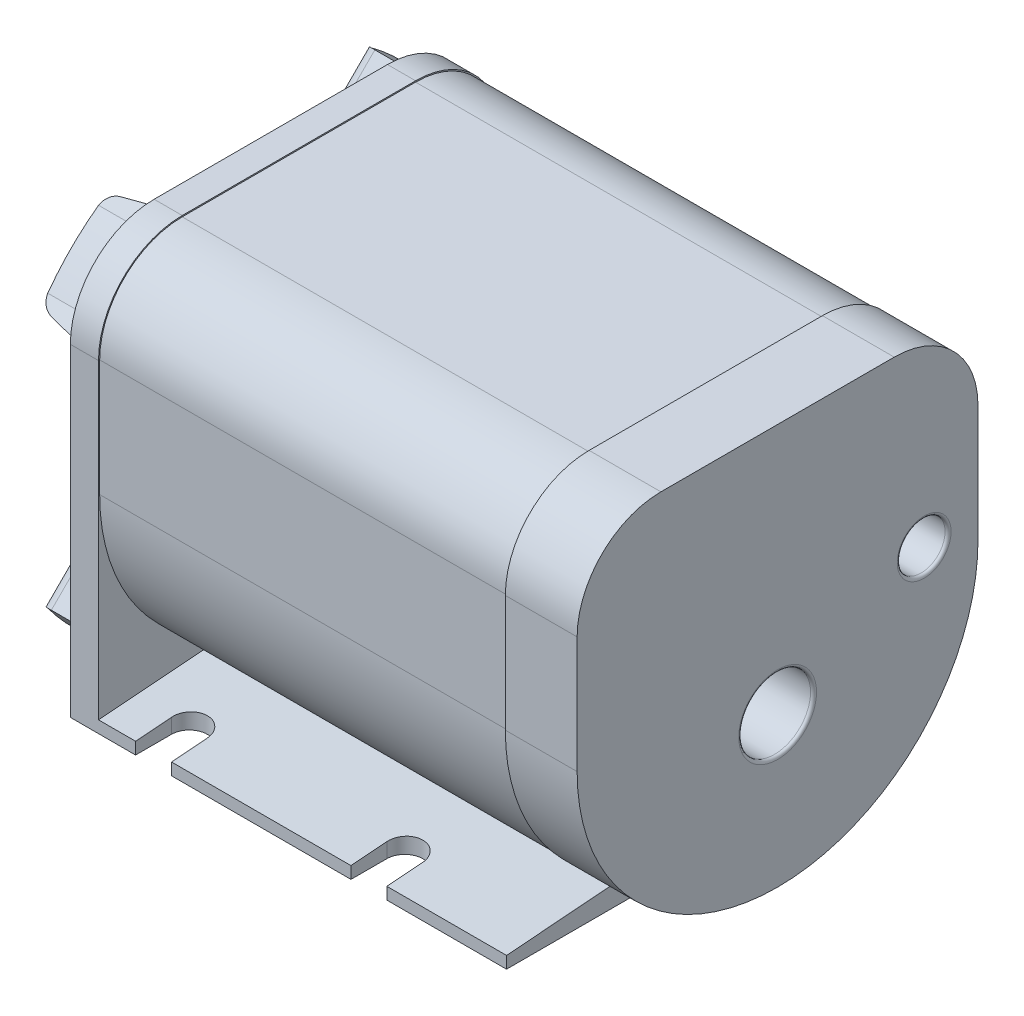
ISO-10303-21;
HEADER;
FILE_DESCRIPTION(('STEP AP214'),'2;1');
FILE_NAME('part.step','',(''),(''),'','','');
FILE_SCHEMA(('AUTOMOTIVE_DESIGN { 1 0 10303 214 1 1 1 1 }'));
ENDSEC;
DATA;
#1=APPLICATION_CONTEXT('core data for automotive mechanical design processes');
#2=APPLICATION_PROTOCOL_DEFINITION('international standard','automotive_design',2000,#1);
#3=PRODUCT_CONTEXT('',#1,'mechanical');
#4=PRODUCT('Part','Part','',(#3));
#5=PRODUCT_RELATED_PRODUCT_CATEGORY('part','',(#4));
#6=PRODUCT_DEFINITION_FORMATION('','',#4);
#7=PRODUCT_DEFINITION_CONTEXT('part definition',#1,'design');
#8=PRODUCT_DEFINITION('design','',#6,#7);
#9=PRODUCT_DEFINITION_SHAPE('','',#8);
#10=(LENGTH_UNIT() NAMED_UNIT(*) SI_UNIT(.MILLI.,.METRE.));
#11=(NAMED_UNIT(*) PLANE_ANGLE_UNIT() SI_UNIT($,.RADIAN.));
#12=(NAMED_UNIT(*) SI_UNIT($,.STERADIAN.) SOLID_ANGLE_UNIT());
#13=UNCERTAINTY_MEASURE_WITH_UNIT(LENGTH_MEASURE(1.E-05),#10,'distance_accuracy_value','');
#14=(GEOMETRIC_REPRESENTATION_CONTEXT(3) GLOBAL_UNCERTAINTY_ASSIGNED_CONTEXT((#13)) GLOBAL_UNIT_ASSIGNED_CONTEXT((#10,
#11,#12)) REPRESENTATION_CONTEXT('',''));
#15=CARTESIAN_POINT('',(0.,0.,0.));
#16=DIRECTION('',(0.,0.,1.));
#17=DIRECTION('',(1.,0.,0.));
#18=AXIS2_PLACEMENT_3D('',#15,#16,#17);
#19=CARTESIAN_POINT('',(-42.35,26.5,0.));
#20=DIRECTION('',(0.,0.,-1.));
#21=DIRECTION('',(0.,1.,0.));
#22=AXIS2_PLACEMENT_3D('',#19,#20,#21);
#23=PLANE('',#22);
#24=DIRECTION('',(1.,0.,0.));
#25=VECTOR('',#24,1.);
#26=CARTESIAN_POINT('',(-42.35,-0.5,0.));
#27=LINE('',#26,#25);
#28=CARTESIAN_POINT('',(-42.35,-0.5,0.));
#29=VERTEX_POINT('',#28);
#30=CARTESIAN_POINT('',(-36.9,-0.5,1.24958345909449E-13));
#31=VERTEX_POINT('',#30);
#32=EDGE_CURVE('E798',#29,#31,#27,.T.);
#33=ORIENTED_EDGE('',*,*,#32,.T.);
#34=DIRECTION('',(0.,-1.,0.));
#35=VECTOR('',#34,1.);
#36=CARTESIAN_POINT('',(-36.9,4.5,1.24375789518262E-13));
#37=LINE('',#36,#35);
#38=CARTESIAN_POINT('',(-36.9,0.500000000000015,1.24841834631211E-13));
#39=VERTEX_POINT('',#38);
#40=EDGE_CURVE('E473',#39,#31,#37,.T.);
#41=ORIENTED_EDGE('',*,*,#40,.F.);
#42=DIRECTION('',(-1.,0.,0.));
#43=VECTOR('',#42,1.);
#44=CARTESIAN_POINT('',(-5.9,0.500000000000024,0.));
#45=LINE('',#44,#43);
#46=CARTESIAN_POINT('',(-40.,0.500000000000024,0.));
#47=VERTEX_POINT('',#46);
#48=EDGE_CURVE('E874',#39,#47,#45,.T.);
#49=ORIENTED_EDGE('',*,*,#48,.T.);
#50=DIRECTION('',(0.,1.,0.));
#51=VECTOR('',#50,1.);
#52=CARTESIAN_POINT('',(-40.,26.5,0.));
#53=LINE('',#52,#51);
#54=CARTESIAN_POINT('',(-40.,26.5,0.));
#55=VERTEX_POINT('',#54);
#56=EDGE_CURVE('E853',#47,#55,#53,.T.);
#57=ORIENTED_EDGE('',*,*,#56,.T.);
#58=DIRECTION('',(1.,0.,0.));
#59=VECTOR('',#58,1.);
#60=CARTESIAN_POINT('',(-42.35,26.5,0.));
#61=LINE('',#60,#59);
#62=CARTESIAN_POINT('',(-42.35,26.5,0.));
#63=VERTEX_POINT('',#62);
#64=EDGE_CURVE('E811',#63,#55,#61,.T.);
#65=ORIENTED_EDGE('',*,*,#64,.F.);
#66=DIRECTION('',(0.,1.,0.));
#67=VECTOR('',#66,1.);
#68=CARTESIAN_POINT('',(-42.35,26.5,0.));
#69=LINE('',#68,#67);
#70=EDGE_CURVE('E801',#29,#63,#69,.T.);
#71=ORIENTED_EDGE('',*,*,#70,.F.);
#72=EDGE_LOOP('',(#33,#41,#49,#57,#65,#71));
#73=FACE_BOUND('',#72,.T.);
#74=ADVANCED_FACE('F26',(#73),#23,.F.);
#75=CARTESIAN_POINT('',(-18.9,0.500000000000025,0.));
#76=VERTEX_POINT('',#75);
#77=CARTESIAN_POINT('',(-33.9,0.500000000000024,0.));
#78=VERTEX_POINT('',#77);
#79=EDGE_CURVE('E873',#76,#78,#45,.T.);
#80=ORIENTED_EDGE('',*,*,#79,.T.);
#81=DIRECTION('',(0.,-1.,0.));
#82=VECTOR('',#81,1.);
#83=CARTESIAN_POINT('',(-33.9,4.5,1.24375789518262E-13));
#84=LINE('',#83,#82);
#85=CARTESIAN_POINT('',(-33.9,-0.5,1.24958345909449E-13));
#86=VERTEX_POINT('',#85);
#87=EDGE_CURVE('E41',#78,#86,#84,.T.);
#88=ORIENTED_EDGE('',*,*,#87,.T.);
#89=CARTESIAN_POINT('',(-18.9,-0.5,0.));
#90=VERTEX_POINT('',#89);
#91=EDGE_CURVE('E466',#86,#90,#27,.T.);
#92=ORIENTED_EDGE('',*,*,#91,.T.);
#93=DIRECTION('',(0.,-1.,0.));
#94=VECTOR('',#93,1.);
#95=CARTESIAN_POINT('',(-18.9,4.5,0.));
#96=LINE('',#95,#94);
#97=EDGE_CURVE('E487',#76,#90,#96,.T.);
#98=ORIENTED_EDGE('',*,*,#97,.F.);
#99=EDGE_LOOP('',(#80,#88,#92,#98));
#100=FACE_BOUND('',#99,.T.);
#101=ADVANCED_FACE('F733',(#100),#23,.F.);
#102=CARTESIAN_POINT('',(-42.35,-0.500000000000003,-33.5));
#103=DIRECTION('',(0.,0.,1.));
#104=DIRECTION('',(1.,0.,0.));
#105=AXIS2_PLACEMENT_3D('',#102,#103,#104);
#106=PLANE('',#105);
#107=DIRECTION('',(1.,0.,0.));
#108=VECTOR('',#107,1.);
#109=CARTESIAN_POINT('',(-42.35,-0.500000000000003,-33.5));
#110=LINE('',#109,#108);
#111=CARTESIAN_POINT('',(-15.9,-0.500000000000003,-33.5));
#112=VERTEX_POINT('',#111);
#113=CARTESIAN_POINT('',(-5.9,-0.500000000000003,-33.5));
#114=VERTEX_POINT('',#113);
#115=EDGE_CURVE('E832',#112,#114,#110,.T.);
#116=ORIENTED_EDGE('',*,*,#115,.F.);
#117=DIRECTION('',(0.,-1.,0.));
#118=VECTOR('',#117,1.);
#119=CARTESIAN_POINT('',(-15.9,4.5,-33.5));
#120=LINE('',#119,#118);
#121=CARTESIAN_POINT('',(-15.9,0.499999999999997,-33.5));
#122=VERTEX_POINT('',#121);
#123=EDGE_CURVE('E503',#122,#112,#120,.T.);
#124=ORIENTED_EDGE('',*,*,#123,.F.);
#125=DIRECTION('',(-1.,0.,0.));
#126=VECTOR('',#125,1.);
#127=CARTESIAN_POINT('',(-5.9,0.499999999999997,-33.5));
#128=LINE('',#127,#126);
#129=CARTESIAN_POINT('',(-5.9,0.499999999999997,-33.5));
#130=VERTEX_POINT('',#129);
#131=EDGE_CURVE('E858',#130,#122,#128,.T.);
#132=ORIENTED_EDGE('',*,*,#131,.F.);
#133=DIRECTION('',(0.,1.,0.));
#134=VECTOR('',#133,1.);
#135=CARTESIAN_POINT('',(-5.9,-0.500000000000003,-33.5));
#136=LINE('',#135,#134);
#137=EDGE_CURVE('E883',#114,#130,#136,.T.);
#138=ORIENTED_EDGE('',*,*,#137,.F.);
#139=EDGE_LOOP('',(#116,#124,#132,#138));
#140=FACE_BOUND('',#139,.T.);
#141=ADVANCED_FACE('F717',(#140),#106,.F.);
#142=CARTESIAN_POINT('',(-18.9,0.499999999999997,-33.5));
#143=VERTEX_POINT('',#142);
#144=CARTESIAN_POINT('',(-33.9,0.499999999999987,-33.5000000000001));
#145=VERTEX_POINT('',#144);
#146=EDGE_CURVE('E861',#143,#145,#128,.T.);
#147=ORIENTED_EDGE('',*,*,#146,.F.);
#148=DIRECTION('',(0.,-1.,0.));
#149=VECTOR('',#148,1.);
#150=CARTESIAN_POINT('',(-18.9,4.5,-33.5));
#151=LINE('',#150,#149);
#152=CARTESIAN_POINT('',(-18.9,-0.500000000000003,-33.5));
#153=VERTEX_POINT('',#152);
#154=EDGE_CURVE('E505',#143,#153,#151,.T.);
#155=ORIENTED_EDGE('',*,*,#154,.T.);
#156=CARTESIAN_POINT('',(-33.9,-0.500000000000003,-33.5000000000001));
#157=VERTEX_POINT('',#156);
#158=EDGE_CURVE('E831',#157,#153,#110,.T.);
#159=ORIENTED_EDGE('',*,*,#158,.F.);
#160=DIRECTION('',(0.,-1.,0.));
#161=VECTOR('',#160,1.);
#162=CARTESIAN_POINT('',(-33.9,4.5,-33.5000000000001));
#163=LINE('',#162,#161);
#164=EDGE_CURVE('E520',#145,#157,#163,.T.);
#165=ORIENTED_EDGE('',*,*,#164,.F.);
#166=EDGE_LOOP('',(#147,#155,#159,#165));
#167=FACE_BOUND('',#166,.T.);
#168=ADVANCED_FACE('F603',(#167),#106,.F.);
#169=CARTESIAN_POINT('',(-42.35,4.29358763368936,-10.6575486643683));
#170=DIRECTION('',(0.209006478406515,0.691489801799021,0.691489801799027));
#171=DIRECTION('',(0.,-0.707106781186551,0.707106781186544));
#172=AXIS2_PLACEMENT_3D('',#169,#170,#171);
#173=PLANE('',#172);
#174=CARTESIAN_POINT('',(-63.4049174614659,16.75,-16.75));
#175=DIRECTION('',(0.209006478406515,0.691489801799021,0.691489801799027));
#176=DIRECTION('',(0.977914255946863,-0.147789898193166,-0.147789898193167));
#177=AXIS2_PLACEMENT_3D('',#174,#175,#176);
#178=ELLIPSE('',#177,71.7681103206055,15.);
#179=CARTESIAN_POINT('',(-42.35,3.44996631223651,-9.81392734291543));
#180=VERTEX_POINT('',#179);
#181=CARTESIAN_POINT('',(-44.2818527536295,3.65469486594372,-9.4347431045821));
#182=VERTEX_POINT('',#181);
#183=EDGE_CURVE('E1116',#180,#182,#178,.F.);
#184=ORIENTED_EDGE('',*,*,#183,.F.);
#185=DIRECTION('',(0.,-0.707106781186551,0.707106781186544));
#186=VECTOR('',#185,1.);
#187=CARTESIAN_POINT('',(-42.35,4.29358763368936,-10.6575486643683));
#188=LINE('',#187,#186);
#189=CARTESIAN_POINT('',(-42.35,0.0509469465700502,-6.41490797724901));
#190=VERTEX_POINT('',#189);
#191=EDGE_CURVE('E1039',#180,#190,#188,.T.);
#192=ORIENTED_EDGE('',*,*,#191,.T.);
#193=DIRECTION('',(-0.977914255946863,0.147789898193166,0.147789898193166));
#194=VECTOR('',#193,1.);
#195=CARTESIAN_POINT('',(-42.35,0.0509469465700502,-6.41490797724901));
#196=LINE('',#195,#194);
#197=CARTESIAN_POINT('',(-44.2818527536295,0.342903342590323,-6.12295158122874));
#198=VERTEX_POINT('',#197);
#199=EDGE_CURVE('E1046',#190,#198,#196,.T.);
#200=ORIENTED_EDGE('',*,*,#199,.T.);
#201=DIRECTION('',(0.,-0.707106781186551,0.707106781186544));
#202=VECTOR('',#201,1.);
#203=CARTESIAN_POINT('',(-44.2818527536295,4.58554402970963,-10.365592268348));
#204=LINE('',#203,#202);
#205=EDGE_CURVE('E1041',#182,#198,#204,.T.);
#206=ORIENTED_EDGE('',*,*,#205,.F.);
#207=EDGE_LOOP('',(#184,#192,#200,#206));
#208=FACE_BOUND('',#207,.T.);
#209=ADVANCED_FACE('F599',(#208),#173,.F.);
#210=CARTESIAN_POINT('',(-43.9928317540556,5.54175876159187,-9.40937753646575));
#211=DIRECTION('',(0.,-0.707106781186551,0.707106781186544));
#212=DIRECTION('',(0.,-0.707106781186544,-0.707106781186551));
#213=AXIS2_PLACEMENT_3D('',#210,#211,#212);
#214=CYLINDRICAL_SURFACE('',#213,1.38283273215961);
#215=CARTESIAN_POINT('',(-44.2818527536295,3.65469486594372,-9.4347431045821));
#216=CARTESIAN_POINT('',(-44.3195621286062,3.65878029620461,-9.42743125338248));
#217=CARTESIAN_POINT('',(-44.3568886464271,3.66366511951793,-9.41869940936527));
#218=CARTESIAN_POINT('',(-44.430538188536,3.67500613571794,-9.39849165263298));
#219=CARTESIAN_POINT('',(-44.4668614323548,3.68146198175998,-9.38701634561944));
#220=CARTESIAN_POINT('',(-44.5737780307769,3.70310436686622,-9.34869083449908));
#221=CARTESIAN_POINT('',(-44.6425495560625,3.72059086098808,-9.31789553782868));
#222=CARTESIAN_POINT('',(-44.7731641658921,3.76128229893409,-9.24700902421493));
#223=CARTESIAN_POINT('',(-44.8350101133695,3.78448486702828,-9.20692166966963));
#224=CARTESIAN_POINT('',(-44.9503376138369,3.83614823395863,-9.11881166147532));
#225=CARTESIAN_POINT('',(-45.0038147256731,3.86461180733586,-9.07078482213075));
#226=CARTESIAN_POINT('',(-45.1022969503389,3.92698455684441,-8.96706834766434));
#227=CARTESIAN_POINT('',(-45.1470554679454,3.96101257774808,-8.91121651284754));
#228=CARTESIAN_POINT('',(-45.225253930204,4.03325307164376,-8.79455937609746));
#229=CARTESIAN_POINT('',(-45.2587030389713,4.07146212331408,-8.73375813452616));
#230=CARTESIAN_POINT('',(-45.2998697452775,4.13141022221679,-8.63996954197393));
#231=CARTESIAN_POINT('',(-45.3121252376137,4.15193011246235,-8.60812674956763));
#232=CARTESIAN_POINT('',(-45.3334524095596,4.19365634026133,-8.54392294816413));
#233=CARTESIAN_POINT('',(-45.3425300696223,4.21486130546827,-8.51156303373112));
#234=CARTESIAN_POINT('',(-45.3500000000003,4.23637481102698,-8.47901549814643));
#235=B_SPLINE_CURVE_WITH_KNOTS('',3,(#215,#216,#217,#218,#219,#220,#221,#222,#223,#224,#225,
#226,#227,#228,#229,#230,#231,#232,#233,#234),.UNSPECIFIED.,.F.,.F.,(4,2,2,2,2,2,2,2,2,4),(0.,
0.115809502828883,0.231593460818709,0.462459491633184,0.693229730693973,0.924122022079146,
1.16081502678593,1.39731577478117,1.51664202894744,1.63574249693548),.UNSPECIFIED.);
#236=CARTESIAN_POINT('',(-45.35,4.23637481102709,-8.47901549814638));
#237=VERTEX_POINT('',#236);
#238=EDGE_CURVE('E575',#182,#237,#235,.T.);
#239=ORIENTED_EDGE('',*,*,#238,.F.);
#240=ORIENTED_EDGE('',*,*,#205,.T.);
#241=CARTESIAN_POINT('',(-43.9928317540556,1.29911807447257,-5.16673684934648));
#242=DIRECTION('',(0.,0.707106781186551,-0.707106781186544));
#243=DIRECTION('',(0.,0.707106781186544,0.707106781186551));
#244=AXIS2_PLACEMENT_3D('',#241,#242,#243);
#245=CIRCLE('',#244,1.38283273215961);
#246=CARTESIAN_POINT('',(-45.35,1.11160711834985,-5.35424780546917));
#247=VERTEX_POINT('',#246);
#248=EDGE_CURVE('E1043',#198,#247,#245,.T.);
#249=ORIENTED_EDGE('',*,*,#248,.T.);
#250=DIRECTION('',(0.,-0.707106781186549,0.707106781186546));
#251=VECTOR('',#250,1.);
#252=CARTESIAN_POINT('',(-45.35,4.23637481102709,-8.47901549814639));
#253=LINE('',#252,#251);
#254=EDGE_CURVE('E985',#237,#247,#253,.T.);
#255=ORIENTED_EDGE('',*,*,#254,.F.);
#256=EDGE_LOOP('',(#239,#240,#249,#255));
#257=FACE_BOUND('',#256,.T.);
#258=ADVANCED_FACE('F588',(#257),#214,.T.);
#259=CARTESIAN_POINT('',(-43.9928317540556,9.40937753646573,-5.54175876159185));
#260=DIRECTION('',(0.,-0.707106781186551,0.707106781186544));
#261=DIRECTION('',(0.,-0.707106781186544,-0.707106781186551));
#262=AXIS2_PLACEMENT_3D('',#259,#260,#261);
#263=CYLINDRICAL_SURFACE('',#262,1.38283273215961);
#264=CARTESIAN_POINT('',(-45.35,8.47901549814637,-4.23637481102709));
#265=CARTESIAN_POINT('',(-45.3423954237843,8.51214890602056,-4.21447401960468));
#266=CARTESIAN_POINT('',(-45.3331251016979,8.54508731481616,-4.19289339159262));
#267=CARTESIAN_POINT('',(-45.3113203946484,8.61036066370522,-4.15048483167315));
#268=CARTESIAN_POINT('',(-45.2987861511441,8.64269562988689,-4.12965686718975));
#269=CARTESIAN_POINT('',(-45.2564183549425,8.73840969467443,-4.06851227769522));
#270=CARTESIAN_POINT('',(-45.2218028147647,8.80057130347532,-4.0294866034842));
#271=CARTESIAN_POINT('',(-45.1407799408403,8.91960210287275,-3.95586911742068));
#272=CARTESIAN_POINT('',(-45.0943679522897,8.97646919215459,-3.92127906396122));
#273=CARTESIAN_POINT('',(-44.9909414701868,9.08307180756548,-3.85728579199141));
#274=CARTESIAN_POINT('',(-44.933926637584,9.13280710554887,-3.82788273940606));
#275=CARTESIAN_POINT('',(-44.8113270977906,9.22299041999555,-3.7751457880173));
#276=CARTESIAN_POINT('',(-44.7458159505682,9.26351076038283,-3.75176442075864));
#277=CARTESIAN_POINT('',(-44.607697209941,9.33418472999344,-3.7113133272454));
#278=CARTESIAN_POINT('',(-44.5351005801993,9.36435405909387,-3.6942340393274));
#279=CARTESIAN_POINT('',(-44.4310226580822,9.3981663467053,-3.67519001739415));
#280=CARTESIAN_POINT('',(-44.4015741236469,9.40674267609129,-3.67037269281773));
#281=CARTESIAN_POINT('',(-44.3421167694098,9.42209528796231,-3.66176525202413));
#282=CARTESIAN_POINT('',(-44.312108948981,9.42887450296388,-3.65797346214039));
#283=CARTESIAN_POINT('',(-44.2818527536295,9.43474310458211,-3.65469486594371));
#284=B_SPLINE_CURVE_WITH_KNOTS('',3,(#264,#265,#266,#267,#268,#269,#270,#271,#272,#273,#274,
#275,#276,#277,#278,#279,#280,#281,#282,#283),.UNSPECIFIED.,.F.,.F.,(4,2,2,2,2,2,2,2,2,4),(0.,
0.121241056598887,0.242476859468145,0.484683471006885,0.72698580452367,0.969295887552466,
1.20963296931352,1.44960389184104,1.54268892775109,1.63562111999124),.UNSPECIFIED.);
#285=CARTESIAN_POINT('',(-45.35,8.47901549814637,-4.23637481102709));
#286=VERTEX_POINT('',#285);
#287=CARTESIAN_POINT('',(-44.2818527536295,9.43474310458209,-3.65469486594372));
#288=VERTEX_POINT('',#287);
#289=EDGE_CURVE('E569',#286,#288,#284,.T.);
#290=ORIENTED_EDGE('',*,*,#289,.F.);
#291=DIRECTION('',(0.,0.707106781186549,-0.707106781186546));
#292=VECTOR('',#291,1.);
#293=CARTESIAN_POINT('',(-45.35,8.47901549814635,-4.2363748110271));
#294=LINE('',#293,#292);
#295=CARTESIAN_POINT('',(-45.35,5.35424780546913,-1.11160711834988));
#296=VERTEX_POINT('',#295);
#297=EDGE_CURVE('E977',#296,#286,#294,.T.);
#298=ORIENTED_EDGE('',*,*,#297,.F.);
#299=CARTESIAN_POINT('',(-43.9928317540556,5.16673684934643,-1.29911807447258));
#300=DIRECTION('',(0.,0.707106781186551,-0.707106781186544));
#301=DIRECTION('',(0.,-0.707106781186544,-0.707106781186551));
#302=AXIS2_PLACEMENT_3D('',#299,#300,#301);
#303=CIRCLE('',#302,1.38283273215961);
#304=CARTESIAN_POINT('',(-44.2818527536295,6.12295158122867,-0.34290334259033));
#305=VERTEX_POINT('',#304);
#306=EDGE_CURVE('E1062',#296,#305,#303,.T.);
#307=ORIENTED_EDGE('',*,*,#306,.T.);
#308=DIRECTION('',(0.,-0.707106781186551,0.707106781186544));
#309=VECTOR('',#308,1.);
#310=CARTESIAN_POINT('',(-44.2818527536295,10.365592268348,-4.5855440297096));
#311=LINE('',#310,#309);
#312=EDGE_CURVE('E1052',#288,#305,#311,.T.);
#313=ORIENTED_EDGE('',*,*,#312,.F.);
#314=EDGE_LOOP('',(#290,#298,#307,#313));
#315=FACE_BOUND('',#314,.T.);
#316=ADVANCED_FACE('F582',(#315),#263,.T.);
#317=CARTESIAN_POINT('',(-42.35,10.6575486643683,-4.29358763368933));
#318=DIRECTION('',(0.209006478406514,-0.691489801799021,-0.691489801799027));
#319=DIRECTION('',(0.,0.707106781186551,-0.707106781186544));
#320=AXIS2_PLACEMENT_3D('',#317,#318,#319);
#321=PLANE('',#320);
#322=CARTESIAN_POINT('',(-63.4049174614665,16.75,-16.75));
#323=DIRECTION('',(0.209006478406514,-0.691489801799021,-0.691489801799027));
#324=DIRECTION('',(0.977914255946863,0.147789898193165,0.147789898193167));
#325=AXIS2_PLACEMENT_3D('',#322,#323,#324);
#326=ELLIPSE('',#325,71.7681103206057,15.);
#327=CARTESIAN_POINT('',(-42.35,9.81392734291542,-3.44996631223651));
#328=VERTEX_POINT('',#327);
#329=EDGE_CURVE('E576',#288,#328,#326,.F.);
#330=ORIENTED_EDGE('',*,*,#329,.F.);
#331=ORIENTED_EDGE('',*,*,#312,.T.);
#332=DIRECTION('',(0.977914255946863,0.147789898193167,0.147789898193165));
#333=VECTOR('',#332,1.);
#334=CARTESIAN_POINT('',(-42.35,6.41490797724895,-0.0509469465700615));
#335=LINE('',#334,#333);
#336=CARTESIAN_POINT('',(-42.35,6.41490797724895,-0.0509469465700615));
#337=VERTEX_POINT('',#336);
#338=EDGE_CURVE('E1059',#305,#337,#335,.T.);
#339=ORIENTED_EDGE('',*,*,#338,.T.);
#340=DIRECTION('',(0.,-0.707106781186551,0.707106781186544));
#341=VECTOR('',#340,1.);
#342=CARTESIAN_POINT('',(-42.35,10.6575486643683,-4.29358763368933));
#343=LINE('',#342,#341);
#344=EDGE_CURVE('E1054',#328,#337,#343,.T.);
#345=ORIENTED_EDGE('',*,*,#344,.F.);
#346=EDGE_LOOP('',(#330,#331,#339,#345));
#347=FACE_BOUND('',#346,.T.);
#348=ADVANCED_FACE('F587',(#347),#321,.F.);
#349=CARTESIAN_POINT('',(-42.35,10.6575486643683,-29.2064123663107));
#350=DIRECTION('',(0.209006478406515,-0.69148980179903,0.691489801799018));
#351=DIRECTION('',(0.,-0.707106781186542,-0.707106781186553));
#352=AXIS2_PLACEMENT_3D('',#349,#350,#351);
#353=PLANE('',#352);
#354=CARTESIAN_POINT('',(-63.4049174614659,16.75,-16.75));
#355=DIRECTION('',(0.209006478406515,-0.69148980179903,0.691489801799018));
#356=DIRECTION('',(0.977914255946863,0.147789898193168,-0.147789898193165));
#357=AXIS2_PLACEMENT_3D('',#354,#355,#356);
#358=ELLIPSE('',#357,71.7681103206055,15.);
#359=CARTESIAN_POINT('',(-42.35,9.81392734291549,-30.0500336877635));
#360=VERTEX_POINT('',#359);
#361=CARTESIAN_POINT('',(-44.2818527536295,9.43474310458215,-29.8453051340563));
#362=VERTEX_POINT('',#361);
#363=EDGE_CURVE('E1133',#360,#362,#358,.F.);
#364=ORIENTED_EDGE('',*,*,#363,.F.);
#365=DIRECTION('',(0.,-0.707106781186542,-0.707106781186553));
#366=VECTOR('',#365,1.);
#367=CARTESIAN_POINT('',(-42.35,10.6575486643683,-29.2064123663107));
#368=LINE('',#367,#366);
#369=CARTESIAN_POINT('',(-42.35,6.41490797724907,-33.44905305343));
#370=VERTEX_POINT('',#369);
#371=EDGE_CURVE('E1065',#360,#370,#368,.T.);
#372=ORIENTED_EDGE('',*,*,#371,.T.);
#373=DIRECTION('',(-0.977914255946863,-0.147789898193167,0.147789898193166));
#374=VECTOR('',#373,1.);
#375=CARTESIAN_POINT('',(-42.35,6.41490797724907,-33.44905305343));
#376=LINE('',#375,#374);
#377=CARTESIAN_POINT('',(-44.2818527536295,6.1229515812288,-33.1570966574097));
#378=VERTEX_POINT('',#377);
#379=EDGE_CURVE('E1072',#370,#378,#376,.T.);
#380=ORIENTED_EDGE('',*,*,#379,.T.);
#381=DIRECTION('',(0.,-0.707106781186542,-0.707106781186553));
#382=VECTOR('',#381,1.);
#383=CARTESIAN_POINT('',(-44.2818527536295,10.365592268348,-28.9144559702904));
#384=LINE('',#383,#382);
#385=EDGE_CURVE('E1067',#362,#378,#384,.T.);
#386=ORIENTED_EDGE('',*,*,#385,.F.);
#387=EDGE_LOOP('',(#364,#372,#380,#386));
#388=FACE_BOUND('',#387,.T.);
#389=ADVANCED_FACE('F1619',(#388),#353,.F.);
#390=CARTESIAN_POINT('',(-43.9928317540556,9.40937753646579,-27.9582412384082));
#391=DIRECTION('',(0.,-0.707106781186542,-0.707106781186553));
#392=DIRECTION('',(0.,0.707106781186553,-0.707106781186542));
#393=AXIS2_PLACEMENT_3D('',#390,#391,#392);
#394=CYLINDRICAL_SURFACE('',#393,1.38283273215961);
#395=CARTESIAN_POINT('',(-44.2818527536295,9.43474310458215,-29.8453051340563));
#396=CARTESIAN_POINT('',(-44.3195621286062,9.42743125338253,-29.8412197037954));
#397=CARTESIAN_POINT('',(-44.3568886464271,9.41869940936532,-29.8363348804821));
#398=CARTESIAN_POINT('',(-44.430538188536,9.39849165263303,-29.8249938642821));
#399=CARTESIAN_POINT('',(-44.4668614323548,9.38701634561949,-29.81853801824));
#400=CARTESIAN_POINT('',(-44.5737780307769,9.34869083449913,-29.7968956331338));
#401=CARTESIAN_POINT('',(-44.6425495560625,9.31789553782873,-29.7794091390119));
#402=CARTESIAN_POINT('',(-44.7731641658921,9.24700902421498,-29.7387177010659));
#403=CARTESIAN_POINT('',(-44.8350101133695,9.20692166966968,-29.7155151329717));
#404=CARTESIAN_POINT('',(-44.9503376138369,9.11881166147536,-29.6638517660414));
#405=CARTESIAN_POINT('',(-45.0038147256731,9.07078482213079,-29.6353881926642));
#406=CARTESIAN_POINT('',(-45.1022969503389,8.96706834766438,-29.5730154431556));
#407=CARTESIAN_POINT('',(-45.1470554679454,8.91121651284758,-29.5389874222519));
#408=CARTESIAN_POINT('',(-45.225253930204,8.7945593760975,-29.4667469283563));
#409=CARTESIAN_POINT('',(-45.2587030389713,8.7337581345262,-29.4285378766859));
#410=CARTESIAN_POINT('',(-45.2998697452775,8.63996954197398,-29.3685897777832));
#411=CARTESIAN_POINT('',(-45.3121252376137,8.60812674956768,-29.3480698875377));
#412=CARTESIAN_POINT('',(-45.3334524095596,8.54392294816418,-29.3063436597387));
#413=CARTESIAN_POINT('',(-45.3425300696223,8.51156303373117,-29.2851386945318));
#414=CARTESIAN_POINT('',(-45.3500000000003,8.47901549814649,-29.2636251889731));
#415=B_SPLINE_CURVE_WITH_KNOTS('',3,(#395,#396,#397,#398,#399,#400,#401,#402,#403,#404,#405,
#406,#407,#408,#409,#410,#411,#412,#413,#414),.UNSPECIFIED.,.F.,.F.,(4,2,2,2,2,2,2,2,2,4),(0.,
0.115809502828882,0.231593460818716,0.462459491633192,0.693229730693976,0.924122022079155,
1.16081502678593,1.39731577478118,1.51664202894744,1.63574249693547),.UNSPECIFIED.);
#416=CARTESIAN_POINT('',(-45.35,8.47901549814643,-29.2636251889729));
#417=VERTEX_POINT('',#416);
#418=EDGE_CURVE('E562',#362,#417,#415,.T.);
#419=ORIENTED_EDGE('',*,*,#418,.F.);
#420=ORIENTED_EDGE('',*,*,#385,.T.);
#421=CARTESIAN_POINT('',(-43.9928317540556,5.16673684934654,-32.2008819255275));
#422=DIRECTION('',(0.,0.707106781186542,0.707106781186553));
#423=DIRECTION('',(0.,-0.707106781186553,0.707106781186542));
#424=AXIS2_PLACEMENT_3D('',#421,#422,#423);
#425=CIRCLE('',#424,1.38283273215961);
#426=CARTESIAN_POINT('',(-45.35,5.35424780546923,-32.3883928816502));
#427=VERTEX_POINT('',#426);
#428=EDGE_CURVE('E1069',#378,#427,#425,.T.);
#429=ORIENTED_EDGE('',*,*,#428,.T.);
#430=DIRECTION('',(0.,-0.707106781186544,-0.707106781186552));
#431=VECTOR('',#430,1.);
#432=CARTESIAN_POINT('',(-45.35,8.47901549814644,-29.2636251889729));
#433=LINE('',#432,#431);
#434=EDGE_CURVE('E1006',#417,#427,#433,.T.);
#435=ORIENTED_EDGE('',*,*,#434,.F.);
#436=EDGE_LOOP('',(#419,#420,#429,#435));
#437=FACE_BOUND('',#436,.T.);
#438=ADVANCED_FACE('F1625',(#437),#394,.T.);
#439=CARTESIAN_POINT('',(-43.9928317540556,5.54175876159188,-24.0906224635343));
#440=DIRECTION('',(0.,-0.707106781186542,-0.707106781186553));
#441=DIRECTION('',(0.,0.707106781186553,-0.707106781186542));
#442=AXIS2_PLACEMENT_3D('',#439,#440,#441);
#443=CYLINDRICAL_SURFACE('',#442,1.38283273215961);
#444=CARTESIAN_POINT('',(-45.35,4.23637481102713,-25.0209845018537));
#445=CARTESIAN_POINT('',(-45.3423954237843,4.21447401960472,-24.9878510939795));
#446=CARTESIAN_POINT('',(-45.3331251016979,4.19289339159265,-24.9549126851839));
#447=CARTESIAN_POINT('',(-45.3113203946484,4.15048483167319,-24.8896393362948));
#448=CARTESIAN_POINT('',(-45.2987861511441,4.12965686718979,-24.8573043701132));
#449=CARTESIAN_POINT('',(-45.2564183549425,4.06851227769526,-24.7615903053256));
#450=CARTESIAN_POINT('',(-45.2218028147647,4.02948660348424,-24.6994286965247));
#451=CARTESIAN_POINT('',(-45.1407799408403,3.95586911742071,-24.5803978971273));
#452=CARTESIAN_POINT('',(-45.0943679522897,3.92127906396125,-24.5235308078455));
#453=CARTESIAN_POINT('',(-44.9909414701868,3.85728579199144,-24.4169281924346));
#454=CARTESIAN_POINT('',(-44.933926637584,3.8278827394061,-24.3671928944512));
#455=CARTESIAN_POINT('',(-44.8113270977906,3.77514578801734,-24.2770095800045));
#456=CARTESIAN_POINT('',(-44.7458159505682,3.75176442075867,-24.2364892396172));
#457=CARTESIAN_POINT('',(-44.607697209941,3.71131332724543,-24.1658152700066));
#458=CARTESIAN_POINT('',(-44.5351005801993,3.69423403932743,-24.1356459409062));
#459=CARTESIAN_POINT('',(-44.4310226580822,3.67519001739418,-24.1018336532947));
#460=CARTESIAN_POINT('',(-44.4015741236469,3.67037269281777,-24.0932573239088));
#461=CARTESIAN_POINT('',(-44.3421167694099,3.66176525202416,-24.0779047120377));
#462=CARTESIAN_POINT('',(-44.312108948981,3.65797346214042,-24.0711254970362));
#463=CARTESIAN_POINT('',(-44.2818527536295,3.65469486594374,-24.0652568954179));
#464=B_SPLINE_CURVE_WITH_KNOTS('',3,(#444,#445,#446,#447,#448,#449,#450,#451,#452,#453,#454,
#455,#456,#457,#458,#459,#460,#461,#462,#463),.UNSPECIFIED.,.F.,.F.,(4,2,2,2,2,2,2,2,2,4),(0.,
0.121241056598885,0.242476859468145,0.484683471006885,0.726985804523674,0.969295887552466,
1.20963296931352,1.44960389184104,1.54268892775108,1.63562111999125),.UNSPECIFIED.);
#465=CARTESIAN_POINT('',(-45.35,4.23637481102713,-25.0209845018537));
#466=VERTEX_POINT('',#465);
#467=CARTESIAN_POINT('',(-44.2818527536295,3.65469486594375,-24.065256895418));
#468=VERTEX_POINT('',#467);
#469=EDGE_CURVE('E555',#466,#468,#464,.T.);
#470=ORIENTED_EDGE('',*,*,#469,.F.);
#471=DIRECTION('',(0.,0.707106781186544,0.707106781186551));
#472=VECTOR('',#471,1.);
#473=CARTESIAN_POINT('',(-45.35,4.23637481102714,-25.0209845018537));
#474=LINE('',#473,#472);
#475=CARTESIAN_POINT('',(-45.35,1.11160711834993,-28.1457521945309));
#476=VERTEX_POINT('',#475);
#477=EDGE_CURVE('E1000',#476,#466,#474,.T.);
#478=ORIENTED_EDGE('',*,*,#477,.F.);
#479=CARTESIAN_POINT('',(-43.9928317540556,1.29911807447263,-28.3332631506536));
#480=DIRECTION('',(0.,0.707106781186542,0.707106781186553));
#481=DIRECTION('',(0.,0.707106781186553,-0.707106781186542));
#482=AXIS2_PLACEMENT_3D('',#479,#480,#481);
#483=CIRCLE('',#482,1.38283273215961);
#484=CARTESIAN_POINT('',(-44.2818527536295,0.342903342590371,-27.3770484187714));
#485=VERTEX_POINT('',#484);
#486=EDGE_CURVE('E1088',#476,#485,#483,.T.);
#487=ORIENTED_EDGE('',*,*,#486,.T.);
#488=DIRECTION('',(0.,-0.707106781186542,-0.707106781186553));
#489=VECTOR('',#488,1.);
#490=CARTESIAN_POINT('',(-44.2818527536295,4.58554402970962,-23.1344077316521));
#491=LINE('',#490,#489);
#492=EDGE_CURVE('E1078',#468,#485,#491,.T.);
#493=ORIENTED_EDGE('',*,*,#492,.F.);
#494=EDGE_LOOP('',(#470,#478,#487,#493));
#495=FACE_BOUND('',#494,.T.);
#496=ADVANCED_FACE('F1633',(#495),#443,.T.);
#497=CARTESIAN_POINT('',(-42.35,4.29358763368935,-22.8424513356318));
#498=DIRECTION('',(0.209006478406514,0.69148980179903,-0.691489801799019));
#499=DIRECTION('',(0.,0.707106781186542,0.707106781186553));
#500=AXIS2_PLACEMENT_3D('',#497,#498,#499);
#501=PLANE('',#500);
#502=CARTESIAN_POINT('',(-63.4049174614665,16.75,-16.75));
#503=DIRECTION('',(0.209006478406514,0.69148980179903,-0.691489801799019));
#504=DIRECTION('',(0.977914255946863,-0.147789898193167,0.147789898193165));
#505=AXIS2_PLACEMENT_3D('',#502,#503,#504);
#506=ELLIPSE('',#505,71.7681103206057,15.);
#507=CARTESIAN_POINT('',(-42.35,3.44996631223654,-23.6860726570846));
#508=VERTEX_POINT('',#507);
#509=EDGE_CURVE('E1138',#468,#508,#506,.F.);
#510=ORIENTED_EDGE('',*,*,#509,.F.);
#511=ORIENTED_EDGE('',*,*,#492,.T.);
#512=DIRECTION('',(0.977914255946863,-0.147789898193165,0.147789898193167));
#513=VECTOR('',#512,1.);
#514=CARTESIAN_POINT('',(-42.35,0.0509469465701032,-27.0850920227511));
#515=LINE('',#514,#513);
#516=CARTESIAN_POINT('',(-42.35,0.0509469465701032,-27.0850920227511));
#517=VERTEX_POINT('',#516);
#518=EDGE_CURVE('E1085',#485,#517,#515,.T.);
#519=ORIENTED_EDGE('',*,*,#518,.T.);
#520=DIRECTION('',(0.,-0.707106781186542,-0.707106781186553));
#521=VECTOR('',#520,1.);
#522=CARTESIAN_POINT('',(-42.35,4.29358763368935,-22.8424513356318));
#523=LINE('',#522,#521);
#524=EDGE_CURVE('E1080',#508,#517,#523,.T.);
#525=ORIENTED_EDGE('',*,*,#524,.F.);
#526=EDGE_LOOP('',(#510,#511,#519,#525));
#527=FACE_BOUND('',#526,.T.);
#528=ADVANCED_FACE('F1640',(#527),#501,.F.);
#529=CARTESIAN_POINT('',(-42.35,29.2064123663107,-22.8424513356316));
#530=DIRECTION('',(0.209006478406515,-0.691489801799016,-0.691489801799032));
#531=DIRECTION('',(0.,0.707106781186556,-0.707106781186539));
#532=AXIS2_PLACEMENT_3D('',#529,#530,#531);
#533=PLANE('',#532);
#534=CARTESIAN_POINT('',(-63.4049174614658,16.75,-16.75));
#535=DIRECTION('',(0.209006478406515,-0.691489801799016,-0.691489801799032));
#536=DIRECTION('',(0.977914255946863,0.147789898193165,0.147789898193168));
#537=AXIS2_PLACEMENT_3D('',#534,#535,#536);
#538=ELLIPSE('',#537,71.7681103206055,15.);
#539=CARTESIAN_POINT('',(-42.35,30.0500336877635,-23.6860726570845));
#540=VERTEX_POINT('',#539);
#541=CARTESIAN_POINT('',(-44.2818527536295,29.8453051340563,-24.0652568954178));
#542=VERTEX_POINT('',#541);
#543=EDGE_CURVE('E1141',#540,#542,#538,.F.);
#544=ORIENTED_EDGE('',*,*,#543,.F.);
#545=DIRECTION('',(0.,0.707106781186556,-0.707106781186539));
#546=VECTOR('',#545,1.);
#547=CARTESIAN_POINT('',(-42.35,29.2064123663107,-22.8424513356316));
#548=LINE('',#547,#546);
#549=CARTESIAN_POINT('',(-42.35,33.44905305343,-27.0850920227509));
#550=VERTEX_POINT('',#549);
#551=EDGE_CURVE('E1091',#540,#550,#548,.T.);
#552=ORIENTED_EDGE('',*,*,#551,.T.);
#553=DIRECTION('',(-0.977914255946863,-0.147789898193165,-0.147789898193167));
#554=VECTOR('',#553,1.);
#555=CARTESIAN_POINT('',(-42.35,33.44905305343,-27.0850920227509));
#556=LINE('',#555,#554);
#557=CARTESIAN_POINT('',(-44.2818527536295,33.1570966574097,-27.3770484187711));
#558=VERTEX_POINT('',#557);
#559=EDGE_CURVE('E1098',#550,#558,#556,.T.);
#560=ORIENTED_EDGE('',*,*,#559,.T.);
#561=DIRECTION('',(0.,0.707106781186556,-0.707106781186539));
#562=VECTOR('',#561,1.);
#563=CARTESIAN_POINT('',(-44.2818527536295,28.9144559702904,-23.1344077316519));
#564=LINE('',#563,#562);
#565=EDGE_CURVE('E1093',#542,#558,#564,.T.);
#566=ORIENTED_EDGE('',*,*,#565,.F.);
#567=EDGE_LOOP('',(#544,#552,#560,#566));
#568=FACE_BOUND('',#567,.T.);
#569=ADVANCED_FACE('F1647',(#568),#533,.F.);
#570=CARTESIAN_POINT('',(-43.9928317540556,27.9582412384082,-24.0906224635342));
#571=DIRECTION('',(0.,0.707106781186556,-0.707106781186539));
#572=DIRECTION('',(0.,0.707106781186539,0.707106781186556));
#573=AXIS2_PLACEMENT_3D('',#570,#571,#572);
#574=CYLINDRICAL_SURFACE('',#573,1.38283273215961);
#575=CARTESIAN_POINT('',(-44.2818527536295,29.8453051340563,-24.0652568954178));
#576=CARTESIAN_POINT('',(-44.3195621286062,29.8412197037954,-24.0725687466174));
#577=CARTESIAN_POINT('',(-44.3568886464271,29.8363348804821,-24.0813005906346));
#578=CARTESIAN_POINT('',(-44.430538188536,29.8249938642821,-24.1015083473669));
#579=CARTESIAN_POINT('',(-44.4668614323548,29.8185380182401,-24.1129836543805));
#580=CARTESIAN_POINT('',(-44.5737780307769,29.7968956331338,-24.1513091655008));
#581=CARTESIAN_POINT('',(-44.6425495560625,29.779409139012,-24.1821044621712));
#582=CARTESIAN_POINT('',(-44.7731641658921,29.738717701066,-24.252990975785));
#583=CARTESIAN_POINT('',(-44.8350101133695,29.7155151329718,-24.2930783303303));
#584=CARTESIAN_POINT('',(-44.9503376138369,29.6638517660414,-24.3811883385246));
#585=CARTESIAN_POINT('',(-45.0038147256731,29.6353881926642,-24.4292151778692));
#586=CARTESIAN_POINT('',(-45.1022969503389,29.5730154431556,-24.5329316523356));
#587=CARTESIAN_POINT('',(-45.1470554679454,29.538987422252,-24.5887834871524));
#588=CARTESIAN_POINT('',(-45.225253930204,29.4667469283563,-24.7054406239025));
#589=CARTESIAN_POINT('',(-45.2587030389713,29.428537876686,-24.7662418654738));
#590=CARTESIAN_POINT('',(-45.2998697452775,29.3685897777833,-24.860030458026));
#591=CARTESIAN_POINT('',(-45.3121252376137,29.3480698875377,-24.8918732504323));
#592=CARTESIAN_POINT('',(-45.3334524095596,29.3063436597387,-24.9560770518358));
#593=CARTESIAN_POINT('',(-45.3425300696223,29.2851386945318,-24.9884369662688));
#594=CARTESIAN_POINT('',(-45.3500000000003,29.2636251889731,-25.0209845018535));
#595=B_SPLINE_CURVE_WITH_KNOTS('',3,(#575,#576,#577,#578,#579,#580,#581,#582,#583,#584,#585,
#586,#587,#588,#589,#590,#591,#592,#593,#594),.UNSPECIFIED.,.F.,.F.,(4,2,2,2,2,2,2,2,2,4),(0.,
0.115809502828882,0.231593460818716,0.462459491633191,0.693229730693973,0.924122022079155,
1.16081502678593,1.39731577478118,1.51664202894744,1.63574249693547),.UNSPECIFIED.);
#596=CARTESIAN_POINT('',(-45.35,29.263625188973,-25.0209845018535));
#597=VERTEX_POINT('',#596);
#598=EDGE_CURVE('E532',#542,#597,#595,.T.);
#599=ORIENTED_EDGE('',*,*,#598,.F.);
#600=ORIENTED_EDGE('',*,*,#565,.T.);
#601=CARTESIAN_POINT('',(-43.9928317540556,32.2008819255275,-28.3332631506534));
#602=DIRECTION('',(0.,-0.707106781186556,0.707106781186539));
#603=DIRECTION('',(0.,-0.707106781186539,-0.707106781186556));
#604=AXIS2_PLACEMENT_3D('',#601,#602,#603);
#605=CIRCLE('',#604,1.38283273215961);
#606=CARTESIAN_POINT('',(-45.35,32.3883928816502,-28.1457521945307));
#607=VERTEX_POINT('',#606);
#608=EDGE_CURVE('E1095',#558,#607,#605,.T.);
#609=ORIENTED_EDGE('',*,*,#608,.T.);
#610=DIRECTION('',(0.,0.707106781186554,-0.707106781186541));
#611=VECTOR('',#610,1.);
#612=CARTESIAN_POINT('',(-45.35,29.263625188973,-25.0209845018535));
#613=LINE('',#612,#611);
#614=EDGE_CURVE('E1028',#597,#607,#613,.T.);
#615=ORIENTED_EDGE('',*,*,#614,.F.);
#616=EDGE_LOOP('',(#599,#600,#609,#615));
#617=FACE_BOUND('',#616,.T.);
#618=ADVANCED_FACE('F1149',(#617),#574,.T.);
#619=CARTESIAN_POINT('',(-43.9928317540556,24.0906224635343,-27.9582412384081));
#620=DIRECTION('',(0.,0.707106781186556,-0.707106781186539));
#621=DIRECTION('',(0.,0.707106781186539,0.707106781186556));
#622=AXIS2_PLACEMENT_3D('',#619,#620,#621);
#623=CYLINDRICAL_SURFACE('',#622,1.38283273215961);
#624=CARTESIAN_POINT('',(-45.35,25.0209845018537,-29.2636251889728));
#625=CARTESIAN_POINT('',(-45.3423954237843,24.9878510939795,-29.2855259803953));
#626=CARTESIAN_POINT('',(-45.3331251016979,24.9549126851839,-29.3071066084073));
#627=CARTESIAN_POINT('',(-45.3113203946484,24.8896393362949,-29.3495151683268));
#628=CARTESIAN_POINT('',(-45.2987861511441,24.8573043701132,-29.3703431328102));
#629=CARTESIAN_POINT('',(-45.2564183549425,24.7615903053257,-29.4314877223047));
#630=CARTESIAN_POINT('',(-45.2218028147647,24.6994286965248,-29.4705133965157));
#631=CARTESIAN_POINT('',(-45.1407799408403,24.5803978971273,-29.5441308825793));
#632=CARTESIAN_POINT('',(-45.0943679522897,24.5235308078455,-29.5787209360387));
#633=CARTESIAN_POINT('',(-44.9909414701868,24.4169281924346,-29.6427142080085));
#634=CARTESIAN_POINT('',(-44.933926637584,24.3671928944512,-29.6721172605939));
#635=CARTESIAN_POINT('',(-44.8113270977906,24.2770095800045,-29.7248542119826));
#636=CARTESIAN_POINT('',(-44.7458159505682,24.2364892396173,-29.7482355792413));
#637=CARTESIAN_POINT('',(-44.607697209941,24.1658152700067,-29.7886866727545));
#638=CARTESIAN_POINT('',(-44.5351005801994,24.1356459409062,-29.8057659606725));
#639=CARTESIAN_POINT('',(-44.4310226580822,24.1018336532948,-29.8248099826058));
#640=CARTESIAN_POINT('',(-44.4015741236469,24.0932573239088,-29.8296273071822));
#641=CARTESIAN_POINT('',(-44.3421167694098,24.0779047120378,-29.8382347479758));
#642=CARTESIAN_POINT('',(-44.312108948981,24.0711254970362,-29.8420265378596));
#643=CARTESIAN_POINT('',(-44.2818527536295,24.065256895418,-29.8453051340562));
#644=B_SPLINE_CURVE_WITH_KNOTS('',3,(#624,#625,#626,#627,#628,#629,#630,#631,#632,#633,#634,
#635,#636,#637,#638,#639,#640,#641,#642,#643),.UNSPECIFIED.,.F.,.F.,(4,2,2,2,2,2,2,2,2,4),(0.,
0.12124105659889,0.242476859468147,0.48468347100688,0.726985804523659,0.969295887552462,
1.20963296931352,1.44960389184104,1.54268892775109,1.63562111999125),.UNSPECIFIED.);
#645=CARTESIAN_POINT('',(-45.35,25.0209845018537,-29.2636251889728));
#646=VERTEX_POINT('',#645);
#647=CARTESIAN_POINT('',(-44.2818527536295,24.065256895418,-29.8453051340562));
#648=VERTEX_POINT('',#647);
#649=EDGE_CURVE('E519',#646,#648,#644,.T.);
#650=ORIENTED_EDGE('',*,*,#649,.F.);
#651=DIRECTION('',(0.,-0.707106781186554,0.707106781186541));
#652=VECTOR('',#651,1.);
#653=CARTESIAN_POINT('',(-45.35,25.0209845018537,-29.2636251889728));
#654=LINE('',#653,#652);
#655=CARTESIAN_POINT('',(-45.35,28.145752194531,-32.38839288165));
#656=VERTEX_POINT('',#655);
#657=EDGE_CURVE('E1022',#656,#646,#654,.T.);
#658=ORIENTED_EDGE('',*,*,#657,.F.);
#659=CARTESIAN_POINT('',(-43.9928317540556,28.3332631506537,-32.2008819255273));
#660=DIRECTION('',(0.,-0.707106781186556,0.707106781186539));
#661=DIRECTION('',(0.,0.707106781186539,0.707106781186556));
#662=AXIS2_PLACEMENT_3D('',#659,#660,#661);
#663=CIRCLE('',#662,1.38283273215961);
#664=CARTESIAN_POINT('',(-44.2818527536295,27.3770484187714,-33.1570966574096));
#665=VERTEX_POINT('',#664);
#666=EDGE_CURVE('E1114',#656,#665,#663,.T.);
#667=ORIENTED_EDGE('',*,*,#666,.T.);
#668=DIRECTION('',(0.,0.707106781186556,-0.707106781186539));
#669=VECTOR('',#668,1.);
#670=CARTESIAN_POINT('',(-44.2818527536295,23.1344077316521,-28.9144559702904));
#671=LINE('',#670,#669);
#672=EDGE_CURVE('E1104',#648,#665,#671,.T.);
#673=ORIENTED_EDGE('',*,*,#672,.F.);
#674=EDGE_LOOP('',(#650,#658,#667,#673));
#675=FACE_BOUND('',#674,.T.);
#676=ADVANCED_FACE('F538',(#675),#623,.T.);
#677=CARTESIAN_POINT('',(-42.35,22.8424513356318,-29.2064123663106));
#678=DIRECTION('',(0.209006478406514,0.691489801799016,0.691489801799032));
#679=DIRECTION('',(0.,-0.707106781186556,0.707106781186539));
#680=AXIS2_PLACEMENT_3D('',#677,#678,#679);
#681=PLANE('',#680);
#682=CARTESIAN_POINT('',(-63.4049174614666,16.75,-16.75));
#683=DIRECTION('',(0.209006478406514,0.691489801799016,0.691489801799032));
#684=DIRECTION('',(0.977914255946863,-0.147789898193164,-0.147789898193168));
#685=AXIS2_PLACEMENT_3D('',#682,#683,#684);
#686=ELLIPSE('',#685,71.7681103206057,15.);
#687=CARTESIAN_POINT('',(-42.35,23.6860726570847,-30.0500336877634));
#688=VERTEX_POINT('',#687);
#689=EDGE_CURVE('E1163',#648,#688,#686,.F.);
#690=ORIENTED_EDGE('',*,*,#689,.F.);
#691=ORIENTED_EDGE('',*,*,#672,.T.);
#692=DIRECTION('',(0.977914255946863,-0.147789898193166,-0.147789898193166));
#693=VECTOR('',#692,1.);
#694=CARTESIAN_POINT('',(-42.35,27.0850920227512,-33.4490530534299));
#695=LINE('',#694,#693);
#696=CARTESIAN_POINT('',(-42.35,27.0850920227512,-33.4490530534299));
#697=VERTEX_POINT('',#696);
#698=EDGE_CURVE('E1111',#665,#697,#695,.T.);
#699=ORIENTED_EDGE('',*,*,#698,.T.);
#700=DIRECTION('',(0.,0.707106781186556,-0.707106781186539));
#701=VECTOR('',#700,1.);
#702=CARTESIAN_POINT('',(-42.35,22.8424513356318,-29.2064123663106));
#703=LINE('',#702,#701);
#704=EDGE_CURVE('E1106',#688,#697,#703,.T.);
#705=ORIENTED_EDGE('',*,*,#704,.F.);
#706=EDGE_LOOP('',(#690,#691,#699,#705));
#707=FACE_BOUND('',#706,.T.);
#708=ADVANCED_FACE('F711',(#707),#681,.F.);
#709=CARTESIAN_POINT('',(-42.35,26.5,-26.5));
#710=DIRECTION('',(-1.,0.,0.));
#711=DIRECTION('',(0.,0.,1.));
#712=AXIS2_PLACEMENT_3D('',#709,#710,#711);
#713=PLANE('',#712);
#714=CARTESIAN_POINT('',(-42.35,16.75,-16.75));
#715=DIRECTION('',(1.,0.,0.));
#716=DIRECTION('',(0.,0.,1.));
#717=AXIS2_PLACEMENT_3D('',#714,#715,#716);
#718=CIRCLE('',#717,15.);
#719=EDGE_CURVE('E1015',#508,#360,#718,.T.);
#720=ORIENTED_EDGE('',*,*,#719,.F.);
#721=ORIENTED_EDGE('',*,*,#524,.T.);
#722=DIRECTION('',(0.,0.707106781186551,-0.707106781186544));
#723=VECTOR('',#722,1.);
#724=CARTESIAN_POINT('',(-42.35,1.11160711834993,-28.1457521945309));
#725=LINE('',#724,#723);
#726=CARTESIAN_POINT('',(-42.35,1.11160711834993,-28.1457521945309));
#727=VERTEX_POINT('',#726);
#728=EDGE_CURVE('E1082',#517,#727,#725,.T.);
#729=ORIENTED_EDGE('',*,*,#728,.T.);
#730=CARTESIAN_POINT('',(-42.35,16.75,-16.75));
#731=DIRECTION('',(-1.,0.,0.));
#732=DIRECTION('',(0.,0.,1.));
#733=AXIS2_PLACEMENT_3D('',#730,#731,#732);
#734=CIRCLE('',#733,19.35);
#735=CARTESIAN_POINT('',(-42.35,5.35424780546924,-32.3883928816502));
#736=VERTEX_POINT('',#735);
#737=EDGE_CURVE('E1012',#736,#727,#734,.T.);
#738=ORIENTED_EDGE('',*,*,#737,.F.);
#739=DIRECTION('',(0.,0.707106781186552,-0.707106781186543));
#740=VECTOR('',#739,1.);
#741=CARTESIAN_POINT('',(-42.35,5.35424780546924,-32.3883928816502));
#742=LINE('',#741,#740);
#743=EDGE_CURVE('E1075',#736,#370,#742,.T.);
#744=ORIENTED_EDGE('',*,*,#743,.T.);
#745=ORIENTED_EDGE('',*,*,#371,.F.);
#746=EDGE_LOOP('',(#720,#721,#729,#738,#744,#745));
#747=FACE_BOUND('',#746,.T.);
#748=CARTESIAN_POINT('',(-42.35,16.75,-16.75));
#749=DIRECTION('',(1.,0.,0.));
#750=DIRECTION('',(0.,-1.,0.));
#751=AXIS2_PLACEMENT_3D('',#748,#749,#750);
#752=CIRCLE('',#751,15.);
#753=EDGE_CURVE('E1037',#688,#540,#752,.T.);
#754=ORIENTED_EDGE('',*,*,#753,.F.);
#755=ORIENTED_EDGE('',*,*,#704,.T.);
#756=DIRECTION('',(0.,0.707106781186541,0.707106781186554));
#757=VECTOR('',#756,1.);
#758=CARTESIAN_POINT('',(-42.35,28.145752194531,-32.38839288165));
#759=LINE('',#758,#757);
#760=CARTESIAN_POINT('',(-42.35,28.145752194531,-32.38839288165));
#761=VERTEX_POINT('',#760);
#762=EDGE_CURVE('E1108',#697,#761,#759,.T.);
#763=ORIENTED_EDGE('',*,*,#762,.T.);
#764=CARTESIAN_POINT('',(-42.35,16.75,-16.75));
#765=DIRECTION('',(-1.,0.,0.));
#766=DIRECTION('',(0.,-1.,0.));
#767=AXIS2_PLACEMENT_3D('',#764,#765,#766);
#768=CIRCLE('',#767,19.35);
#769=CARTESIAN_POINT('',(-42.35,32.3883928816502,-28.1457521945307));
#770=VERTEX_POINT('',#769);
#771=EDGE_CURVE('E1034',#770,#761,#768,.T.);
#772=ORIENTED_EDGE('',*,*,#771,.F.);
#773=DIRECTION('',(0.,0.70710678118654,0.707106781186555));
#774=VECTOR('',#773,1.);
#775=CARTESIAN_POINT('',(-42.35,32.3883928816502,-28.1457521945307));
#776=LINE('',#775,#774);
#777=EDGE_CURVE('E1101',#770,#550,#776,.T.);
#778=ORIENTED_EDGE('',*,*,#777,.T.);
#779=ORIENTED_EDGE('',*,*,#551,.F.);
#780=EDGE_LOOP('',(#754,#755,#763,#772,#778,#779));
#781=FACE_BOUND('',#780,.T.);
#782=CARTESIAN_POINT('',(-42.35,16.75,-16.75));
#783=DIRECTION('',(1.,0.,0.));
#784=DIRECTION('',(0.,0.,-1.));
#785=AXIS2_PLACEMENT_3D('',#782,#783,#784);
#786=CIRCLE('',#785,15.);
#787=CARTESIAN_POINT('',(-42.35,30.0500336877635,-9.81392734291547));
#788=VERTEX_POINT('',#787);
#789=CARTESIAN_POINT('',(-42.35,23.6860726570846,-3.44996631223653));
#790=VERTEX_POINT('',#789);
#791=EDGE_CURVE('E920',#788,#790,#786,.T.);
#792=ORIENTED_EDGE('',*,*,#791,.F.);
#793=DIRECTION('',(0.,0.707106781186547,0.707106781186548));
#794=VECTOR('',#793,1.);
#795=CARTESIAN_POINT('',(-42.35,29.2064123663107,-10.6575486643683));
#796=LINE('',#795,#794);
#797=CARTESIAN_POINT('',(-42.35,33.44905305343,-6.414907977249));
#798=VERTEX_POINT('',#797);
#799=EDGE_CURVE('E937',#788,#798,#796,.T.);
#800=ORIENTED_EDGE('',*,*,#799,.T.);
#801=DIRECTION('',(0.,-0.707106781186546,0.707106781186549));
#802=VECTOR('',#801,1.);
#803=CARTESIAN_POINT('',(-42.35,32.3883928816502,-5.35424780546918));
#804=LINE('',#803,#802);
#805=CARTESIAN_POINT('',(-42.35,32.3883928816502,-5.35424780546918));
#806=VERTEX_POINT('',#805);
#807=EDGE_CURVE('E939',#798,#806,#804,.T.);
#808=ORIENTED_EDGE('',*,*,#807,.T.);
#809=CARTESIAN_POINT('',(-42.35,16.75,-16.75));
#810=DIRECTION('',(-1.,0.,0.));
#811=DIRECTION('',(0.,0.,-1.));
#812=AXIS2_PLACEMENT_3D('',#809,#810,#811);
#813=CIRCLE('',#812,19.35);
#814=CARTESIAN_POINT('',(-42.35,28.1457521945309,-1.11160711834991));
#815=VERTEX_POINT('',#814);
#816=EDGE_CURVE('E917',#815,#806,#813,.T.);
#817=ORIENTED_EDGE('',*,*,#816,.F.);
#818=DIRECTION('',(0.,-0.707106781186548,0.707106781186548));
#819=VECTOR('',#818,1.);
#820=CARTESIAN_POINT('',(-42.35,28.1457521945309,-1.11160711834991));
#821=LINE('',#820,#819);
#822=CARTESIAN_POINT('',(-42.35,27.085092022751,-0.0509469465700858));
#823=VERTEX_POINT('',#822);
#824=EDGE_CURVE('E932',#815,#823,#821,.T.);
#825=ORIENTED_EDGE('',*,*,#824,.T.);
#826=DIRECTION('',(0.,0.707106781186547,0.707106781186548));
#827=VECTOR('',#826,1.);
#828=CARTESIAN_POINT('',(-42.35,22.8424513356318,-4.29358763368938));
#829=LINE('',#828,#827);
#830=EDGE_CURVE('E922',#790,#823,#829,.T.);
#831=ORIENTED_EDGE('',*,*,#830,.F.);
#832=EDGE_LOOP('',(#792,#800,#808,#817,#825,#831));
#833=FACE_BOUND('',#832,.T.);
#834=ORIENTED_EDGE('',*,*,#191,.F.);
#835=CARTESIAN_POINT('',(-42.35,16.75,-16.75));
#836=DIRECTION('',(1.,0.,0.));
#837=DIRECTION('',(0.,1.,0.));
#838=AXIS2_PLACEMENT_3D('',#835,#836,#837);
#839=CIRCLE('',#838,15.);
#840=EDGE_CURVE('E993',#328,#180,#839,.T.);
#841=ORIENTED_EDGE('',*,*,#840,.F.);
#842=ORIENTED_EDGE('',*,*,#344,.T.);
#843=DIRECTION('',(0.,-0.707106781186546,-0.707106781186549));
#844=VECTOR('',#843,1.);
#845=CARTESIAN_POINT('',(-42.35,5.35424780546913,-1.11160711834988));
#846=LINE('',#845,#844);
#847=CARTESIAN_POINT('',(-42.35,5.35424780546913,-1.11160711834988));
#848=VERTEX_POINT('',#847);
#849=EDGE_CURVE('E1056',#337,#848,#846,.T.);
#850=ORIENTED_EDGE('',*,*,#849,.T.);
#851=CARTESIAN_POINT('',(-42.35,16.75,-16.75));
#852=DIRECTION('',(-1.,0.,0.));
#853=DIRECTION('',(0.,1.,0.));
#854=AXIS2_PLACEMENT_3D('',#851,#852,#853);
#855=CIRCLE('',#854,19.35);
#856=CARTESIAN_POINT('',(-42.35,1.11160711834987,-5.35424780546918));
#857=VERTEX_POINT('',#856);
#858=EDGE_CURVE('E991',#857,#848,#855,.T.);
#859=ORIENTED_EDGE('',*,*,#858,.F.);
#860=DIRECTION('',(0.,-0.707106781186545,-0.70710678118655));
#861=VECTOR('',#860,1.);
#862=CARTESIAN_POINT('',(-42.35,1.11160711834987,-5.35424780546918));
#863=LINE('',#862,#861);
#864=EDGE_CURVE('E1049',#857,#190,#863,.T.);
#865=ORIENTED_EDGE('',*,*,#864,.T.);
#866=EDGE_LOOP('',(#834,#841,#842,#850,#859,#865));
#867=FACE_BOUND('',#866,.T.);
#868=DIRECTION('',(0.,0.,1.));
#869=VECTOR('',#868,1.);
#870=CARTESIAN_POINT('',(-42.35,-0.5,0.));
#871=LINE('',#870,#869);
#872=CARTESIAN_POINT('',(-42.35,-0.500000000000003,-33.5));
#873=VERTEX_POINT('',#872);
#874=EDGE_CURVE('E842',#873,#29,#871,.T.);
#875=ORIENTED_EDGE('',*,*,#874,.T.);
#876=ORIENTED_EDGE('',*,*,#70,.T.);
#877=CARTESIAN_POINT('',(-42.35,26.5,-7.));
#878=DIRECTION('',(-1.,0.,0.));
#879=DIRECTION('',(0.,0.,1.));
#880=AXIS2_PLACEMENT_3D('',#877,#878,#879);
#881=CIRCLE('',#880,7.);
#882=CARTESIAN_POINT('',(-42.35,33.5,-7.00000000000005));
#883=VERTEX_POINT('',#882);
#884=EDGE_CURVE('E839',#63,#883,#881,.T.);
#885=ORIENTED_EDGE('',*,*,#884,.T.);
#886=DIRECTION('',(0.,0.,-1.));
#887=VECTOR('',#886,1.);
#888=CARTESIAN_POINT('',(-42.35,33.5,-7.00000000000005));
#889=LINE('',#888,#887);
#890=CARTESIAN_POINT('',(-42.35,33.5,-26.5));
#891=VERTEX_POINT('',#890);
#892=EDGE_CURVE('E837',#883,#891,#889,.T.);
#893=ORIENTED_EDGE('',*,*,#892,.T.);
#894=CARTESIAN_POINT('',(-42.35,26.5,-26.5));
#895=DIRECTION('',(-1.,0.,0.));
#896=DIRECTION('',(0.,0.,1.));
#897=AXIS2_PLACEMENT_3D('',#894,#895,#896);
#898=CIRCLE('',#897,7.);
#899=CARTESIAN_POINT('',(-42.35,26.5,-33.5));
#900=VERTEX_POINT('',#899);
#901=EDGE_CURVE('E835',#891,#900,#898,.T.);
#902=ORIENTED_EDGE('',*,*,#901,.T.);
#903=DIRECTION('',(0.,-1.,0.));
#904=VECTOR('',#903,1.);
#905=CARTESIAN_POINT('',(-42.35,-0.500000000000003,-33.5));
#906=LINE('',#905,#904);
#907=EDGE_CURVE('E833',#900,#873,#906,.T.);
#908=ORIENTED_EDGE('',*,*,#907,.T.);
#909=EDGE_LOOP('',(#875,#876,#885,#893,#902,#908));
#910=FACE_BOUND('',#909,.T.);
#911=ADVANCED_FACE('F672',(#747,#781,#833,#867,#910),#713,.T.);
#912=CARTESIAN_POINT('',(-42.35,22.8424513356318,-4.29358763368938));
#913=DIRECTION('',(0.209006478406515,0.691489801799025,-0.691489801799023));
#914=DIRECTION('',(0.,0.707106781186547,0.707106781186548));
#915=AXIS2_PLACEMENT_3D('',#912,#913,#914);
#916=PLANE('',#915);
#917=CARTESIAN_POINT('',(-63.4049174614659,16.75,-16.75));
#918=DIRECTION('',(0.209006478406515,0.691489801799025,-0.691489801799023));
#919=DIRECTION('',(0.977914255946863,-0.147789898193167,0.147789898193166));
#920=AXIS2_PLACEMENT_3D('',#917,#918,#919);
#921=ELLIPSE('',#920,71.7681103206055,15.);
#922=CARTESIAN_POINT('',(-44.2818527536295,24.0652568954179,-3.65469486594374));
#923=VERTEX_POINT('',#922);
#924=EDGE_CURVE('E659',#790,#923,#921,.F.);
#925=ORIENTED_EDGE('',*,*,#924,.F.);
#926=ORIENTED_EDGE('',*,*,#830,.T.);
#927=DIRECTION('',(-0.977914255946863,0.147789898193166,-0.147789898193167));
#928=VECTOR('',#927,1.);
#929=CARTESIAN_POINT('',(-42.35,27.085092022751,-0.0509469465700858));
#930=LINE('',#929,#928);
#931=CARTESIAN_POINT('',(-44.2818527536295,27.3770484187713,-0.34290334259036));
#932=VERTEX_POINT('',#931);
#933=EDGE_CURVE('E929',#823,#932,#930,.T.);
#934=ORIENTED_EDGE('',*,*,#933,.T.);
#935=DIRECTION('',(0.,0.707106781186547,0.707106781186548));
#936=VECTOR('',#935,1.);
#937=CARTESIAN_POINT('',(-44.2818527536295,23.134407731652,-4.58554402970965));
#938=LINE('',#937,#936);
#939=EDGE_CURVE('E924',#923,#932,#938,.T.);
#940=ORIENTED_EDGE('',*,*,#939,.F.);
#941=EDGE_LOOP('',(#925,#926,#934,#940));
#942=FACE_BOUND('',#941,.T.);
#943=ADVANCED_FACE('F667',(#942),#916,.F.);
#944=CARTESIAN_POINT('',(-43.9928317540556,24.0906224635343,-5.5417587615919));
#945=DIRECTION('',(0.,0.707106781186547,0.707106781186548));
#946=DIRECTION('',(0.,-0.707106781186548,0.707106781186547));
#947=AXIS2_PLACEMENT_3D('',#944,#945,#946);
#948=CYLINDRICAL_SURFACE('',#947,1.38283273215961);
#949=CARTESIAN_POINT('',(-44.2818527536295,24.0652568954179,-3.65469486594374));
#950=CARTESIAN_POINT('',(-44.3195621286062,24.0725687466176,-3.65878029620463));
#951=CARTESIAN_POINT('',(-44.3568886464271,24.0813005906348,-3.66366511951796));
#952=CARTESIAN_POINT('',(-44.430538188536,24.1015083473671,-3.67500613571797));
#953=CARTESIAN_POINT('',(-44.4668614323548,24.1129836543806,-3.68146198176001));
#954=CARTESIAN_POINT('',(-44.5737780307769,24.151309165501,-3.70310436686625));
#955=CARTESIAN_POINT('',(-44.6425495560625,24.1821044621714,-3.72059086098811));
#956=CARTESIAN_POINT('',(-44.7731641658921,24.2529909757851,-3.76128229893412));
#957=CARTESIAN_POINT('',(-44.8350101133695,24.2930783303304,-3.78448486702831));
#958=CARTESIAN_POINT('',(-44.9503376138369,24.3811883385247,-3.83614823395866));
#959=CARTESIAN_POINT('',(-45.0038147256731,24.4292151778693,-3.86461180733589));
#960=CARTESIAN_POINT('',(-45.1022969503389,24.5329316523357,-3.92698455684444));
#961=CARTESIAN_POINT('',(-45.1470554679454,24.5887834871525,-3.96101257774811));
#962=CARTESIAN_POINT('',(-45.225253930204,24.7054406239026,-4.03325307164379));
#963=CARTESIAN_POINT('',(-45.2587030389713,24.7662418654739,-4.07146212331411));
#964=CARTESIAN_POINT('',(-45.2998697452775,24.8600304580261,-4.13141022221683));
#965=CARTESIAN_POINT('',(-45.3121252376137,24.8918732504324,-4.15193011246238));
#966=CARTESIAN_POINT('',(-45.3334524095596,24.9560770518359,-4.19365634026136));
#967=CARTESIAN_POINT('',(-45.3425300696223,24.9884369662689,-4.2148613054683));
#968=CARTESIAN_POINT('',(-45.3500000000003,25.0209845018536,-4.23637481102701));
#969=B_SPLINE_CURVE_WITH_KNOTS('',3,(#949,#950,#951,#952,#953,#954,#955,#956,#957,#958,#959,
#960,#961,#962,#963,#964,#965,#966,#967,#968),.UNSPECIFIED.,.F.,.F.,(4,2,2,2,2,2,2,2,2,4),(0.,
0.115809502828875,0.231593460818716,0.462459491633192,0.693229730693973,0.924122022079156,
1.16081502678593,1.39731577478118,1.51664202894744,1.63574249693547),.UNSPECIFIED.);
#970=CARTESIAN_POINT('',(-45.35,25.0209845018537,-4.23637481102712));
#971=VERTEX_POINT('',#970);
#972=EDGE_CURVE('E653',#923,#971,#969,.T.);
#973=ORIENTED_EDGE('',*,*,#972,.F.);
#974=ORIENTED_EDGE('',*,*,#939,.T.);
#975=CARTESIAN_POINT('',(-43.9928317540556,28.3332631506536,-1.29911807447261));
#976=DIRECTION('',(0.,-0.707106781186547,-0.707106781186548));
#977=DIRECTION('',(0.,0.707106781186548,-0.707106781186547));
#978=AXIS2_PLACEMENT_3D('',#975,#976,#977);
#979=CIRCLE('',#978,1.38283273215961);
#980=CARTESIAN_POINT('',(-45.35,28.1457521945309,-1.11160711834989));
#981=VERTEX_POINT('',#980);
#982=EDGE_CURVE('E926',#932,#981,#979,.T.);
#983=ORIENTED_EDGE('',*,*,#982,.T.);
#984=DIRECTION('',(0.,0.707106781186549,0.707106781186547));
#985=VECTOR('',#984,1.);
#986=CARTESIAN_POINT('',(-45.35,25.0209845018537,-4.23637481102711));
#987=LINE('',#986,#985);
#988=EDGE_CURVE('E911',#971,#981,#987,.T.);
#989=ORIENTED_EDGE('',*,*,#988,.F.);
#990=EDGE_LOOP('',(#973,#974,#983,#989));
#991=FACE_BOUND('',#990,.T.);
#992=ADVANCED_FACE('F661',(#991),#948,.T.);
#993=CARTESIAN_POINT('',(-43.9928317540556,27.9582412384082,-9.40937753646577));
#994=DIRECTION('',(0.,0.707106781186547,0.707106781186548));
#995=DIRECTION('',(0.,-0.707106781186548,0.707106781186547));
#996=AXIS2_PLACEMENT_3D('',#993,#994,#995);
#997=CYLINDRICAL_SURFACE('',#996,1.38283273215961);
#998=CARTESIAN_POINT('',(-45.35,29.2636251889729,-8.47901549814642));
#999=CARTESIAN_POINT('',(-45.3423954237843,29.2855259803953,-8.5121489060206));
#1000=CARTESIAN_POINT('',(-45.3331251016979,29.3071066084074,-8.54508731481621));
#1001=CARTESIAN_POINT('',(-45.3113203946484,29.3495151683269,-8.61036066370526));
#1002=CARTESIAN_POINT('',(-45.2987861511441,29.3703431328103,-8.64269562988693));
#1003=CARTESIAN_POINT('',(-45.2564183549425,29.4314877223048,-8.73840969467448));
#1004=CARTESIAN_POINT('',(-45.2218028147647,29.4705133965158,-8.80057130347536));
#1005=CARTESIAN_POINT('',(-45.1407799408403,29.5441308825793,-8.9196021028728));
#1006=CARTESIAN_POINT('',(-45.0943679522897,29.5787209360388,-8.97646919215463));
#1007=CARTESIAN_POINT('',(-44.9909414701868,29.6427142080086,-9.08307180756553));
#1008=CARTESIAN_POINT('',(-44.933926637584,29.672117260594,-9.13280710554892));
#1009=CARTESIAN_POINT('',(-44.8113270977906,29.7248542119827,-9.22299041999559));
#1010=CARTESIAN_POINT('',(-44.7458159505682,29.7482355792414,-9.26351076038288));
#1011=CARTESIAN_POINT('',(-44.607697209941,29.7886866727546,-9.33418472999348));
#1012=CARTESIAN_POINT('',(-44.5351005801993,29.8057659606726,-9.36435405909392));
#1013=CARTESIAN_POINT('',(-44.4310226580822,29.8248099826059,-9.39816634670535));
#1014=CARTESIAN_POINT('',(-44.4015741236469,29.8296273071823,-9.40674267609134));
#1015=CARTESIAN_POINT('',(-44.3421167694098,29.8382347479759,-9.42209528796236));
#1016=CARTESIAN_POINT('',(-44.312108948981,29.8420265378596,-9.42887450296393));
#1017=CARTESIAN_POINT('',(-44.2818527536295,29.8453051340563,-9.43474310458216));
#1018=B_SPLINE_CURVE_WITH_KNOTS('',3,(#998,#999,#1000,#1001,#1002,#1003,#1004,#1005,#1006,#1007,
#1008,#1009,#1010,#1011,#1012,#1013,#1014,#1015,#1016,#1017),.UNSPECIFIED.,.F.,.F.,(4,2,2,2,2,2,
2,2,2,4),(0.,0.121241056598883,0.242476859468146,0.484683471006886,0.726985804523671,
0.969295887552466,1.20963296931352,1.44960389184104,1.54268892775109,1.63562111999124),.UNSPECIFIED.);
#1019=CARTESIAN_POINT('',(-45.35,29.2636251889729,-8.47901549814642));
#1020=VERTEX_POINT('',#1019);
#1021=CARTESIAN_POINT('',(-44.2818527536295,29.8453051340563,-9.43474310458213));
#1022=VERTEX_POINT('',#1021);
#1023=EDGE_CURVE('E646',#1020,#1022,#1018,.T.);
#1024=ORIENTED_EDGE('',*,*,#1023,.F.);
#1025=DIRECTION('',(0.,-0.707106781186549,-0.707106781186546));
#1026=VECTOR('',#1025,1.);
#1027=CARTESIAN_POINT('',(-45.35,29.2636251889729,-8.4790154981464));
#1028=LINE('',#1027,#1026);
#1029=CARTESIAN_POINT('',(-45.35,32.3883928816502,-5.35424780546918));
#1030=VERTEX_POINT('',#1029);
#1031=EDGE_CURVE('E905',#1030,#1020,#1028,.T.);
#1032=ORIENTED_EDGE('',*,*,#1031,.F.);
#1033=CARTESIAN_POINT('',(-43.9928317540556,32.2008819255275,-5.16673684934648));
#1034=DIRECTION('',(0.,-0.707106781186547,-0.707106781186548));
#1035=DIRECTION('',(0.,-0.707106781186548,0.707106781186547));
#1036=AXIS2_PLACEMENT_3D('',#1033,#1034,#1035);
#1037=CIRCLE('',#1036,1.38283273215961);
#1038=CARTESIAN_POINT('',(-44.2818527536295,33.1570966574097,-6.12295158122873));
#1039=VERTEX_POINT('',#1038);
#1040=EDGE_CURVE('E944',#1030,#1039,#1037,.T.);
#1041=ORIENTED_EDGE('',*,*,#1040,.T.);
#1042=DIRECTION('',(0.,0.707106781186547,0.707106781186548));
#1043=VECTOR('',#1042,1.);
#1044=CARTESIAN_POINT('',(-44.2818527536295,28.9144559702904,-10.365592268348));
#1045=LINE('',#1044,#1043);
#1046=EDGE_CURVE('E935',#1022,#1039,#1045,.T.);
#1047=ORIENTED_EDGE('',*,*,#1046,.F.);
#1048=EDGE_LOOP('',(#1024,#1032,#1041,#1047));
#1049=FACE_BOUND('',#1048,.T.);
#1050=ADVANCED_FACE('F666',(#1049),#997,.T.);
#1051=CARTESIAN_POINT('',(-42.35,29.2064123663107,-10.6575486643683));
#1052=DIRECTION('',(0.209006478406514,-0.691489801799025,0.691489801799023));
#1053=DIRECTION('',(0.,-0.707106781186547,-0.707106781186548));
#1054=AXIS2_PLACEMENT_3D('',#1051,#1052,#1053);
#1055=PLANE('',#1054);
#1056=CARTESIAN_POINT('',(-63.4049174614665,16.75,-16.75));
#1057=DIRECTION('',(0.209006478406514,-0.691489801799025,0.691489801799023));
#1058=DIRECTION('',(0.977914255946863,0.147789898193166,-0.147789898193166));
#1059=AXIS2_PLACEMENT_3D('',#1056,#1057,#1058);
#1060=ELLIPSE('',#1059,71.7681103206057,15.);
#1061=EDGE_CURVE('E970',#1022,#788,#1060,.F.);
#1062=ORIENTED_EDGE('',*,*,#1061,.F.);
#1063=ORIENTED_EDGE('',*,*,#1046,.T.);
#1064=DIRECTION('',(0.977914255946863,0.147789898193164,-0.147789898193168));
#1065=VECTOR('',#1064,1.);
#1066=CARTESIAN_POINT('',(-42.35,33.44905305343,-6.414907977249));
#1067=LINE('',#1066,#1065);
#1068=EDGE_CURVE('E942',#1039,#798,#1067,.T.);
#1069=ORIENTED_EDGE('',*,*,#1068,.T.);
#1070=ORIENTED_EDGE('',*,*,#799,.F.);
#1071=EDGE_LOOP('',(#1062,#1063,#1069,#1070));
#1072=FACE_BOUND('',#1071,.T.);
#1073=ADVANCED_FACE('F781',(#1072),#1055,.F.);
#1074=CARTESIAN_POINT('',(-6.,16.7603275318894,-16.75));
#1075=DIRECTION('',(1.,0.,0.));
#1076=DIRECTION('',(0.,0.,-1.));
#1077=AXIS2_PLACEMENT_3D('',#1074,#1075,#1076);
#1078=CYLINDRICAL_SURFACE('',#1077,16.7500024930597);
#1079=CARTESIAN_POINT('',(-5.9,16.7603275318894,-16.75));
#1080=DIRECTION('',(-1.,0.,0.));
#1081=DIRECTION('',(0.,0.,-1.));
#1082=AXIS2_PLACEMENT_3D('',#1079,#1080,#1081);
#1083=CIRCLE('',#1082,16.7500024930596);
#1084=CARTESIAN_POINT('',(-5.9,1.3,-23.195219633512));
#1085=VERTEX_POINT('',#1084);
#1086=CARTESIAN_POINT('',(-5.9,1.30000000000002,-10.304780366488));
#1087=VERTEX_POINT('',#1086);
#1088=EDGE_CURVE('E877',#1085,#1087,#1083,.T.);
#1089=ORIENTED_EDGE('',*,*,#1088,.F.);
#1090=DIRECTION('',(-1.,0.,0.));
#1091=VECTOR('',#1090,1.);
#1092=CARTESIAN_POINT('',(-5.9,1.3,-23.195219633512));
#1093=LINE('',#1092,#1091);
#1094=CARTESIAN_POINT('',(-6.,1.29999999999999,-23.195219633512));
#1095=VERTEX_POINT('',#1094);
#1096=EDGE_CURVE('E863',#1085,#1095,#1093,.T.);
#1097=ORIENTED_EDGE('',*,*,#1096,.T.);
#1098=CARTESIAN_POINT('',(-6.,16.7603275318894,-16.75));
#1099=DIRECTION('',(1.,0.,0.));
#1100=DIRECTION('',(0.,0.,-1.));
#1101=AXIS2_PLACEMENT_3D('',#1098,#1099,#1100);
#1102=CIRCLE('',#1101,16.7500024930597);
#1103=CARTESIAN_POINT('',(-6.,16.769466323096,-33.5));
#1104=VERTEX_POINT('',#1103);
#1105=EDGE_CURVE('E1339',#1095,#1104,#1102,.T.);
#1106=ORIENTED_EDGE('',*,*,#1105,.T.);
#1107=DIRECTION('',(1.,0.,0.));
#1108=VECTOR('',#1107,1.);
#1109=CARTESIAN_POINT('',(-6.,16.769466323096,-33.5));
#1110=LINE('',#1109,#1108);
#1111=CARTESIAN_POINT('',(0.,16.769466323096,-33.5));
#1112=VERTEX_POINT('',#1111);
#1113=EDGE_CURVE('E1362',#1104,#1112,#1110,.T.);
#1114=ORIENTED_EDGE('',*,*,#1113,.T.);
#1115=CARTESIAN_POINT('',(0.,16.7603275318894,-16.75));
#1116=DIRECTION('',(1.,0.,0.));
#1117=DIRECTION('',(0.,0.,-1.));
#1118=AXIS2_PLACEMENT_3D('',#1115,#1116,#1117);
#1119=CIRCLE('',#1118,16.7500024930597);
#1120=CARTESIAN_POINT('',(0.,16.7511887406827,0.));
#1121=VERTEX_POINT('',#1120);
#1122=EDGE_CURVE('E1375',#1121,#1112,#1119,.T.);
#1123=ORIENTED_EDGE('',*,*,#1122,.F.);
#1124=DIRECTION('',(1.,0.,0.));
#1125=VECTOR('',#1124,1.);
#1126=CARTESIAN_POINT('',(-6.,16.7511887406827,0.));
#1127=LINE('',#1126,#1125);
#1128=CARTESIAN_POINT('',(-6.,16.7511887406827,0.));
#1129=VERTEX_POINT('',#1128);
#1130=EDGE_CURVE('E1341',#1129,#1121,#1127,.T.);
#1131=ORIENTED_EDGE('',*,*,#1130,.F.);
#1132=CARTESIAN_POINT('',(-6.,1.30000000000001,-10.304780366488));
#1133=VERTEX_POINT('',#1132);
#1134=EDGE_CURVE('E1336',#1129,#1133,#1102,.T.);
#1135=ORIENTED_EDGE('',*,*,#1134,.T.);
#1136=DIRECTION('',(-1.,0.,0.));
#1137=VECTOR('',#1136,1.);
#1138=CARTESIAN_POINT('',(-5.9,1.30000000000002,-10.304780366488));
#1139=LINE('',#1138,#1137);
#1140=EDGE_CURVE('E866',#1087,#1133,#1139,.T.);
#1141=ORIENTED_EDGE('',*,*,#1140,.F.);
#1142=EDGE_LOOP('',(#1089,#1097,#1106,#1114,#1123,#1131,#1135,#1141));
#1143=FACE_BOUND('',#1142,.T.);
#1144=ADVANCED_FACE('F707',(#1143),#1078,.T.);
#1145=CARTESIAN_POINT('',(-40.,26.5,-26.5));
#1146=DIRECTION('',(-1.,0.,0.));
#1147=DIRECTION('',(0.,0.,1.));
#1148=AXIS2_PLACEMENT_3D('',#1145,#1146,#1147);
#1149=PLANE('',#1148);
#1150=DIRECTION('',(0.,1.,0.));
#1151=VECTOR('',#1150,1.);
#1152=CARTESIAN_POINT('',(-40.,16.7511887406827,-0.1));
#1153=LINE('',#1152,#1151);
#1154=CARTESIAN_POINT('',(-40.,16.7511887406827,-0.1));
#1155=VERTEX_POINT('',#1154);
#1156=CARTESIAN_POINT('',(-40.,26.5,-0.100000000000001));
#1157=VERTEX_POINT('',#1156);
#1158=EDGE_CURVE('E1412',#1155,#1157,#1153,.T.);
#1159=ORIENTED_EDGE('',*,*,#1158,.T.);
#1160=CARTESIAN_POINT('',(-40.,26.5,-7.));
#1161=DIRECTION('',(-1.,0.,0.));
#1162=DIRECTION('',(0.,0.,1.));
#1163=AXIS2_PLACEMENT_3D('',#1160,#1161,#1162);
#1164=CIRCLE('',#1163,6.9);
#1165=CARTESIAN_POINT('',(-40.,33.4,-7.00000000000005));
#1166=VERTEX_POINT('',#1165);
#1167=EDGE_CURVE('E1427',#1157,#1166,#1164,.T.);
#1168=ORIENTED_EDGE('',*,*,#1167,.T.);
#1169=DIRECTION('',(0.,0.,-1.));
#1170=VECTOR('',#1169,1.);
#1171=CARTESIAN_POINT('',(-40.,33.4,-7.00000000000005));
#1172=LINE('',#1171,#1170);
#1173=CARTESIAN_POINT('',(-40.,33.4,-26.5));
#1174=VERTEX_POINT('',#1173);
#1175=EDGE_CURVE('E1424',#1166,#1174,#1172,.T.);
#1176=ORIENTED_EDGE('',*,*,#1175,.T.);
#1177=CARTESIAN_POINT('',(-40.,26.5,-26.5));
#1178=DIRECTION('',(-1.,0.,0.));
#1179=DIRECTION('',(0.,0.,1.));
#1180=AXIS2_PLACEMENT_3D('',#1177,#1178,#1179);
#1181=CIRCLE('',#1180,6.9);
#1182=CARTESIAN_POINT('',(-40.,26.5,-33.4));
#1183=VERTEX_POINT('',#1182);
#1184=EDGE_CURVE('E1421',#1174,#1183,#1181,.T.);
#1185=ORIENTED_EDGE('',*,*,#1184,.T.);
#1186=DIRECTION('',(0.,-1.,-1.52960344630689E-09));
#1187=VECTOR('',#1186,1.);
#1188=CARTESIAN_POINT('',(-40.,26.5,-33.4));
#1189=LINE('',#1188,#1187);
#1190=CARTESIAN_POINT('',(-40.,16.7694117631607,-33.4000000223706));
#1191=VERTEX_POINT('',#1190);
#1192=EDGE_CURVE('E1418',#1183,#1191,#1189,.T.);
#1193=ORIENTED_EDGE('',*,*,#1192,.T.);
#1194=CARTESIAN_POINT('',(-40.,16.7603275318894,-16.75));
#1195=DIRECTION('',(-1.,0.,0.));
#1196=DIRECTION('',(0.,0.,1.));
#1197=AXIS2_PLACEMENT_3D('',#1194,#1195,#1196);
#1198=CIRCLE('',#1197,16.6500025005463);
#1199=EDGE_CURVE('E1415',#1191,#1155,#1198,.T.);
#1200=ORIENTED_EDGE('',*,*,#1199,.T.);
#1201=EDGE_LOOP('',(#1159,#1168,#1176,#1185,#1193,#1200));
#1202=FACE_BOUND('',#1201,.T.);
#1203=DIRECTION('',(0.,0.0774009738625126,0.997000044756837));
#1204=VECTOR('',#1203,1.);
#1205=CARTESIAN_POINT('',(-40.,0.499999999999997,-33.5));
#1206=LINE('',#1205,#1204);
#1207=CARTESIAN_POINT('',(-40.,0.499999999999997,-33.5));
#1208=VERTEX_POINT('',#1207);
#1209=CARTESIAN_POINT('',(-40.,1.3,-23.195219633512));
#1210=VERTEX_POINT('',#1209);
#1211=EDGE_CURVE('E897',#1208,#1210,#1206,.T.);
#1212=ORIENTED_EDGE('',*,*,#1211,.F.);
#1213=DIRECTION('',(0.,-1.,0.));
#1214=VECTOR('',#1213,1.);
#1215=CARTESIAN_POINT('',(-40.,-0.500000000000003,-33.5));
#1216=LINE('',#1215,#1214);
#1217=CARTESIAN_POINT('',(-40.,26.5,-33.5));
#1218=VERTEX_POINT('',#1217);
#1219=EDGE_CURVE('E844',#1218,#1208,#1216,.T.);
#1220=ORIENTED_EDGE('',*,*,#1219,.F.);
#1221=CARTESIAN_POINT('',(-40.,26.5,-26.5));
#1222=DIRECTION('',(-1.,0.,0.));
#1223=DIRECTION('',(0.,0.,1.));
#1224=AXIS2_PLACEMENT_3D('',#1221,#1222,#1223);
#1225=CIRCLE('',#1224,7.);
#1226=CARTESIAN_POINT('',(-40.,33.5,-26.5));
#1227=VERTEX_POINT('',#1226);
#1228=EDGE_CURVE('E847',#1227,#1218,#1225,.T.);
#1229=ORIENTED_EDGE('',*,*,#1228,.F.);
#1230=DIRECTION('',(0.,0.,-1.));
#1231=VECTOR('',#1230,1.);
#1232=CARTESIAN_POINT('',(-40.,33.5,-7.00000000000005));
#1233=LINE('',#1232,#1231);
#1234=CARTESIAN_POINT('',(-40.,33.5,-7.00000000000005));
#1235=VERTEX_POINT('',#1234);
#1236=EDGE_CURVE('E849',#1235,#1227,#1233,.T.);
#1237=ORIENTED_EDGE('',*,*,#1236,.F.);
#1238=CARTESIAN_POINT('',(-40.,26.5,-7.));
#1239=DIRECTION('',(-1.,0.,0.));
#1240=DIRECTION('',(0.,0.,1.));
#1241=AXIS2_PLACEMENT_3D('',#1238,#1239,#1240);
#1242=CIRCLE('',#1241,7.);
#1243=EDGE_CURVE('E851',#55,#1235,#1242,.T.);
#1244=ORIENTED_EDGE('',*,*,#1243,.F.);
#1245=ORIENTED_EDGE('',*,*,#56,.F.);
#1246=DIRECTION('',(0.,-0.0774009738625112,0.997000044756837));
#1247=VECTOR('',#1246,1.);
#1248=CARTESIAN_POINT('',(-40.,0.500000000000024,0.));
#1249=LINE('',#1248,#1247);
#1250=CARTESIAN_POINT('',(-40.,1.30000000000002,-10.304780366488));
#1251=VERTEX_POINT('',#1250);
#1252=EDGE_CURVE('E891',#1251,#47,#1249,.T.);
#1253=ORIENTED_EDGE('',*,*,#1252,.F.);
#1254=CARTESIAN_POINT('',(-40.,16.7603275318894,-16.75));
#1255=DIRECTION('',(-1.,0.,0.));
#1256=DIRECTION('',(0.,0.,-1.));
#1257=AXIS2_PLACEMENT_3D('',#1254,#1255,#1256);
#1258=CIRCLE('',#1257,16.7500024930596);
#1259=EDGE_CURVE('E894',#1210,#1251,#1258,.T.);
#1260=ORIENTED_EDGE('',*,*,#1259,.F.);
#1261=EDGE_LOOP('',(#1212,#1220,#1229,#1237,#1244,#1245,#1253,#1260));
#1262=FACE_BOUND('',#1261,.T.);
#1263=ADVANCED_FACE('F703',(#1202,#1262),#1149,.F.);
#1264=CARTESIAN_POINT('',(-6.,26.5,-7.));
#1265=DIRECTION('',(1.,0.,0.));
#1266=DIRECTION('',(0.,0.,-1.));
#1267=AXIS2_PLACEMENT_3D('',#1264,#1265,#1266);
#1268=PLANE('',#1267);
#1269=CARTESIAN_POINT('',(-6.,26.5,-7.));
#1270=DIRECTION('',(1.,0.,0.));
#1271=DIRECTION('',(0.,0.,-1.));
#1272=AXIS2_PLACEMENT_3D('',#1269,#1270,#1271);
#1273=CIRCLE('',#1272,7.);
#1274=CARTESIAN_POINT('',(-6.,33.5,-7.00000000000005));
#1275=VERTEX_POINT('',#1274);
#1276=CARTESIAN_POINT('',(-6.,26.5,0.));
#1277=VERTEX_POINT('',#1276);
#1278=EDGE_CURVE('E1370',#1275,#1277,#1273,.T.);
#1279=ORIENTED_EDGE('',*,*,#1278,.F.);
#1280=DIRECTION('',(0.,0.,1.));
#1281=VECTOR('',#1280,1.);
#1282=CARTESIAN_POINT('',(-6.,33.5,-7.00000000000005));
#1283=LINE('',#1282,#1281);
#1284=CARTESIAN_POINT('',(-6.,33.5,-26.5));
#1285=VERTEX_POINT('',#1284);
#1286=EDGE_CURVE('E1353',#1285,#1275,#1283,.T.);
#1287=ORIENTED_EDGE('',*,*,#1286,.F.);
#1288=CARTESIAN_POINT('',(-6.,26.5,-26.5));
#1289=DIRECTION('',(1.,0.,0.));
#1290=DIRECTION('',(0.,0.,-1.));
#1291=AXIS2_PLACEMENT_3D('',#1288,#1289,#1290);
#1292=CIRCLE('',#1291,7.);
#1293=CARTESIAN_POINT('',(-6.,26.5,-33.5));
#1294=VERTEX_POINT('',#1293);
#1295=EDGE_CURVE('E1345',#1294,#1285,#1292,.T.);
#1296=ORIENTED_EDGE('',*,*,#1295,.F.);
#1297=DIRECTION('',(0.,1.,0.));
#1298=VECTOR('',#1297,1.);
#1299=CARTESIAN_POINT('',(-6.,26.5,-33.5));
#1300=LINE('',#1299,#1298);
#1301=EDGE_CURVE('E1342',#1104,#1294,#1300,.T.);
#1302=ORIENTED_EDGE('',*,*,#1301,.F.);
#1303=ORIENTED_EDGE('',*,*,#1105,.F.);
#1304=CARTESIAN_POINT('',(-6.,16.7603275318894,-16.75));
#1305=DIRECTION('',(1.,0.,0.));
#1306=DIRECTION('',(0.,0.,-1.));
#1307=AXIS2_PLACEMENT_3D('',#1304,#1305,#1306);
#1308=CIRCLE('',#1307,16.7500024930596);
#1309=EDGE_CURVE('E855',#1133,#1095,#1308,.T.);
#1310=ORIENTED_EDGE('',*,*,#1309,.F.);
#1311=ORIENTED_EDGE('',*,*,#1134,.F.);
#1312=DIRECTION('',(0.,-1.,0.));
#1313=VECTOR('',#1312,1.);
#1314=CARTESIAN_POINT('',(-6.,26.5,0.));
#1315=LINE('',#1314,#1313);
#1316=EDGE_CURVE('E1347',#1277,#1129,#1315,.T.);
#1317=ORIENTED_EDGE('',*,*,#1316,.F.);
#1318=EDGE_LOOP('',(#1279,#1287,#1296,#1302,#1303,#1310,#1311,#1317));
#1319=FACE_BOUND('',#1318,.T.);
#1320=CARTESIAN_POINT('',(-6.,26.5,-7.));
#1321=DIRECTION('',(-1.,0.,0.));
#1322=DIRECTION('',(0.,0.,1.));
#1323=AXIS2_PLACEMENT_3D('',#1320,#1321,#1322);
#1324=CIRCLE('',#1323,6.9);
#1325=CARTESIAN_POINT('',(-6.,26.5,-0.100000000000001));
#1326=VERTEX_POINT('',#1325);
#1327=CARTESIAN_POINT('',(-6.,33.4,-7.00000000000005));
#1328=VERTEX_POINT('',#1327);
#1329=EDGE_CURVE('E804',#1326,#1328,#1324,.T.);
#1330=ORIENTED_EDGE('',*,*,#1329,.F.);
#1331=DIRECTION('',(0.,1.,0.));
#1332=VECTOR('',#1331,1.);
#1333=CARTESIAN_POINT('',(-6.,16.7511887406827,-0.1));
#1334=LINE('',#1333,#1332);
#1335=CARTESIAN_POINT('',(-6.,16.7511887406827,-0.1));
#1336=VERTEX_POINT('',#1335);
#1337=EDGE_CURVE('E1430',#1336,#1326,#1334,.T.);
#1338=ORIENTED_EDGE('',*,*,#1337,.F.);
#1339=CARTESIAN_POINT('',(-6.,16.7603275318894,-16.75));
#1340=DIRECTION('',(-1.,0.,0.));
#1341=DIRECTION('',(0.,0.,1.));
#1342=AXIS2_PLACEMENT_3D('',#1339,#1340,#1341);
#1343=CIRCLE('',#1342,16.6500025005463);
#1344=CARTESIAN_POINT('',(-6.,16.7694117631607,-33.4000000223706));
#1345=VERTEX_POINT('',#1344);
#1346=EDGE_CURVE('E1433',#1345,#1336,#1343,.T.);
#1347=ORIENTED_EDGE('',*,*,#1346,.F.);
#1348=DIRECTION('',(0.,-1.,-1.52960344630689E-09));
#1349=VECTOR('',#1348,1.);
#1350=CARTESIAN_POINT('',(-6.,26.5,-33.4));
#1351=LINE('',#1350,#1349);
#1352=CARTESIAN_POINT('',(-6.,26.5,-33.4));
#1353=VERTEX_POINT('',#1352);
#1354=EDGE_CURVE('E1436',#1353,#1345,#1351,.T.);
#1355=ORIENTED_EDGE('',*,*,#1354,.F.);
#1356=CARTESIAN_POINT('',(-6.,26.5,-26.5));
#1357=DIRECTION('',(-1.,0.,0.));
#1358=DIRECTION('',(0.,0.,1.));
#1359=AXIS2_PLACEMENT_3D('',#1356,#1357,#1358);
#1360=CIRCLE('',#1359,6.9);
#1361=CARTESIAN_POINT('',(-6.,33.4,-26.5));
#1362=VERTEX_POINT('',#1361);
#1363=EDGE_CURVE('E1439',#1362,#1353,#1360,.T.);
#1364=ORIENTED_EDGE('',*,*,#1363,.F.);
#1365=DIRECTION('',(0.,0.,-1.));
#1366=VECTOR('',#1365,1.);
#1367=CARTESIAN_POINT('',(-6.,33.4,-7.00000000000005));
#1368=LINE('',#1367,#1366);
#1369=EDGE_CURVE('E808',#1328,#1362,#1368,.T.);
#1370=ORIENTED_EDGE('',*,*,#1369,.F.);
#1371=EDGE_LOOP('',(#1330,#1338,#1347,#1355,#1364,#1370));
#1372=FACE_BOUND('',#1371,.T.);
#1373=ADVANCED_FACE('F706',(#1319,#1372),#1268,.F.);
#1374=CARTESIAN_POINT('',(-6.,26.5,-7.));
#1375=DIRECTION('',(1.,0.,0.));
#1376=DIRECTION('',(0.,0.,-1.));
#1377=AXIS2_PLACEMENT_3D('',#1374,#1375,#1376);
#1378=CYLINDRICAL_SURFACE('',#1377,7.);
#1379=CARTESIAN_POINT('',(0.,26.5,-7.));
#1380=DIRECTION('',(1.,0.,0.));
#1381=DIRECTION('',(0.,0.,-1.));
#1382=AXIS2_PLACEMENT_3D('',#1379,#1380,#1381);
#1383=CIRCLE('',#1382,7.);
#1384=CARTESIAN_POINT('',(0.,33.5,-7.00000000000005));
#1385=VERTEX_POINT('',#1384);
#1386=CARTESIAN_POINT('',(0.,26.5,0.));
#1387=VERTEX_POINT('',#1386);
#1388=EDGE_CURVE('E1368',#1385,#1387,#1383,.T.);
#1389=ORIENTED_EDGE('',*,*,#1388,.F.);
#1390=DIRECTION('',(1.,0.,0.));
#1391=VECTOR('',#1390,1.);
#1392=CARTESIAN_POINT('',(-6.,33.5,-7.00000000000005));
#1393=LINE('',#1392,#1391);
#1394=EDGE_CURVE('E1169',#1275,#1385,#1393,.T.);
#1395=ORIENTED_EDGE('',*,*,#1394,.F.);
#1396=ORIENTED_EDGE('',*,*,#1278,.T.);
#1397=DIRECTION('',(1.,0.,0.));
#1398=VECTOR('',#1397,1.);
#1399=CARTESIAN_POINT('',(-6.,26.5,0.));
#1400=LINE('',#1399,#1398);
#1401=EDGE_CURVE('E1356',#1277,#1387,#1400,.T.);
#1402=ORIENTED_EDGE('',*,*,#1401,.T.);
#1403=EDGE_LOOP('',(#1389,#1395,#1396,#1402));
#1404=FACE_BOUND('',#1403,.T.);
#1405=ADVANCED_FACE('F28',(#1404),#1378,.T.);
#1406=CARTESIAN_POINT('',(-6.,33.5,-7.00000000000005));
#1407=DIRECTION('',(0.,1.,0.));
#1408=DIRECTION('',(0.,0.,1.));
#1409=AXIS2_PLACEMENT_3D('',#1406,#1407,#1408);
#1410=PLANE('',#1409);
#1411=DIRECTION('',(0.,0.,1.));
#1412=VECTOR('',#1411,1.);
#1413=CARTESIAN_POINT('',(0.,33.5,-7.00000000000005));
#1414=LINE('',#1413,#1412);
#1415=CARTESIAN_POINT('',(0.,33.5,-26.5));
#1416=VERTEX_POINT('',#1415);
#1417=EDGE_CURVE('E1379',#1416,#1385,#1414,.T.);
#1418=ORIENTED_EDGE('',*,*,#1417,.F.);
#1419=DIRECTION('',(1.,0.,0.));
#1420=VECTOR('',#1419,1.);
#1421=CARTESIAN_POINT('',(-6.,33.5,-26.5));
#1422=LINE('',#1421,#1420);
#1423=EDGE_CURVE('E1358',#1285,#1416,#1422,.T.);
#1424=ORIENTED_EDGE('',*,*,#1423,.F.);
#1425=ORIENTED_EDGE('',*,*,#1286,.T.);
#1426=ORIENTED_EDGE('',*,*,#1394,.T.);
#1427=EDGE_LOOP('',(#1418,#1424,#1425,#1426));
#1428=FACE_BOUND('',#1427,.T.);
#1429=ADVANCED_FACE('F768',(#1428),#1410,.T.);
#1430=CARTESIAN_POINT('',(-6.,26.5,-26.5));
#1431=DIRECTION('',(1.,0.,0.));
#1432=DIRECTION('',(0.,0.,-1.));
#1433=AXIS2_PLACEMENT_3D('',#1430,#1431,#1432);
#1434=CYLINDRICAL_SURFACE('',#1433,7.);
#1435=CARTESIAN_POINT('',(0.,26.5,-26.5));
#1436=DIRECTION('',(1.,0.,0.));
#1437=DIRECTION('',(0.,0.,-1.));
#1438=AXIS2_PLACEMENT_3D('',#1435,#1436,#1437);
#1439=CIRCLE('',#1438,7.);
#1440=CARTESIAN_POINT('',(0.,26.5,-33.5));
#1441=VERTEX_POINT('',#1440);
#1442=EDGE_CURVE('E1391',#1441,#1416,#1439,.T.);
#1443=ORIENTED_EDGE('',*,*,#1442,.F.);
#1444=DIRECTION('',(1.,0.,0.));
#1445=VECTOR('',#1444,1.);
#1446=CARTESIAN_POINT('',(-6.,26.5,-33.5));
#1447=LINE('',#1446,#1445);
#1448=EDGE_CURVE('E1360',#1294,#1441,#1447,.T.);
#1449=ORIENTED_EDGE('',*,*,#1448,.F.);
#1450=ORIENTED_EDGE('',*,*,#1295,.T.);
#1451=ORIENTED_EDGE('',*,*,#1423,.T.);
#1452=EDGE_LOOP('',(#1443,#1449,#1450,#1451));
#1453=FACE_BOUND('',#1452,.T.);
#1454=ADVANCED_FACE('F771',(#1453),#1434,.T.);
#1455=CARTESIAN_POINT('',(-6.,26.5,-33.5));
#1456=DIRECTION('',(0.,0.,-1.));
#1457=DIRECTION('',(-1.,0.,0.));
#1458=AXIS2_PLACEMENT_3D('',#1455,#1456,#1457);
#1459=PLANE('',#1458);
#1460=DIRECTION('',(0.,1.,0.));
#1461=VECTOR('',#1460,1.);
#1462=CARTESIAN_POINT('',(0.,26.5,-33.5));
#1463=LINE('',#1462,#1461);
#1464=EDGE_CURVE('E1388',#1112,#1441,#1463,.T.);
#1465=ORIENTED_EDGE('',*,*,#1464,.F.);
#1466=ORIENTED_EDGE('',*,*,#1113,.F.);
#1467=ORIENTED_EDGE('',*,*,#1301,.T.);
#1468=ORIENTED_EDGE('',*,*,#1448,.T.);
#1469=EDGE_LOOP('',(#1465,#1466,#1467,#1468));
#1470=FACE_BOUND('',#1469,.T.);
#1471=ADVANCED_FACE('F775',(#1470),#1459,.T.);
#1472=CARTESIAN_POINT('',(-6.,26.5,0.));
#1473=DIRECTION('',(0.,0.,1.));
#1474=DIRECTION('',(0.,-1.,0.));
#1475=AXIS2_PLACEMENT_3D('',#1472,#1473,#1474);
#1476=PLANE('',#1475);
#1477=DIRECTION('',(0.,-1.,0.));
#1478=VECTOR('',#1477,1.);
#1479=CARTESIAN_POINT('',(0.,26.5,0.));
#1480=LINE('',#1479,#1478);
#1481=EDGE_CURVE('E1372',#1387,#1121,#1480,.T.);
#1482=ORIENTED_EDGE('',*,*,#1481,.F.);
#1483=ORIENTED_EDGE('',*,*,#1401,.F.);
#1484=ORIENTED_EDGE('',*,*,#1316,.T.);
#1485=ORIENTED_EDGE('',*,*,#1130,.T.);
#1486=EDGE_LOOP('',(#1482,#1483,#1484,#1485));
#1487=FACE_BOUND('',#1486,.T.);
#1488=ADVANCED_FACE('F763',(#1487),#1476,.T.);
#1489=CARTESIAN_POINT('',(0.,26.5,-7.));
#1490=DIRECTION('',(1.,0.,0.));
#1491=DIRECTION('',(0.,0.,-1.));
#1492=AXIS2_PLACEMENT_3D('',#1489,#1490,#1491);
#1493=PLANE('',#1492);
#1494=CARTESIAN_POINT('',(0.,18.5,-29.));
#1495=DIRECTION('',(1.,0.,0.));
#1496=DIRECTION('',(0.,0.,-1.));
#1497=AXIS2_PLACEMENT_3D('',#1494,#1495,#1496);
#1498=CIRCLE('',#1497,2.25000000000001);
#1499=CARTESIAN_POINT('',(0.,18.5,-31.25));
#1500=VERTEX_POINT('',#1499);
#1501=EDGE_CURVE('E34',#1500,#1500,#1498,.F.);
#1502=ORIENTED_EDGE('',*,*,#1501,.T.);
#1503=EDGE_LOOP('',(#1502));
#1504=FACE_BOUND('',#1503,.T.);
#1505=CARTESIAN_POINT('',(0.,12.5,-16.7555762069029));
#1506=DIRECTION('',(1.,0.,0.));
#1507=DIRECTION('',(0.,0.,-1.));
#1508=AXIS2_PLACEMENT_3D('',#1505,#1506,#1507);
#1509=CIRCLE('',#1508,3.25);
#1510=CARTESIAN_POINT('',(0.,12.5,-20.0055762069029));
#1511=VERTEX_POINT('',#1510);
#1512=EDGE_CURVE('E1204',#1511,#1511,#1509,.F.);
#1513=ORIENTED_EDGE('',*,*,#1512,.T.);
#1514=EDGE_LOOP('',(#1513));
#1515=FACE_BOUND('',#1514,.T.);
#1516=ORIENTED_EDGE('',*,*,#1388,.T.);
#1517=ORIENTED_EDGE('',*,*,#1481,.T.);
#1518=ORIENTED_EDGE('',*,*,#1122,.T.);
#1519=ORIENTED_EDGE('',*,*,#1464,.T.);
#1520=ORIENTED_EDGE('',*,*,#1442,.T.);
#1521=ORIENTED_EDGE('',*,*,#1417,.T.);
#1522=EDGE_LOOP('',(#1516,#1517,#1518,#1519,#1520,#1521));
#1523=FACE_BOUND('',#1522,.T.);
#1524=ADVANCED_FACE('F759',(#1504,#1515,#1523),#1493,.T.);
#1525=CARTESIAN_POINT('',(-40.,26.5,-7.));
#1526=DIRECTION('',(1.,0.,0.));
#1527=DIRECTION('',(0.,0.,-1.));
#1528=AXIS2_PLACEMENT_3D('',#1525,#1526,#1527);
#1529=CYLINDRICAL_SURFACE('',#1528,6.9);
#1530=ORIENTED_EDGE('',*,*,#1329,.T.);
#1531=DIRECTION('',(1.,0.,0.));
#1532=VECTOR('',#1531,1.);
#1533=CARTESIAN_POINT('',(-40.,33.4,-7.00000000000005));
#1534=LINE('',#1533,#1532);
#1535=EDGE_CURVE('E1380',#1166,#1328,#1534,.T.);
#1536=ORIENTED_EDGE('',*,*,#1535,.F.);
#1537=ORIENTED_EDGE('',*,*,#1167,.F.);
#1538=DIRECTION('',(1.,0.,0.));
#1539=VECTOR('',#1538,1.);
#1540=CARTESIAN_POINT('',(-40.,26.5,-0.100000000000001));
#1541=LINE('',#1540,#1539);
#1542=EDGE_CURVE('E1409',#1157,#1326,#1541,.T.);
#1543=ORIENTED_EDGE('',*,*,#1542,.T.);
#1544=EDGE_LOOP('',(#1530,#1536,#1537,#1543));
#1545=FACE_BOUND('',#1544,.T.);
#1546=ADVANCED_FACE('F755',(#1545),#1529,.T.);
#1547=CARTESIAN_POINT('',(-40.,33.4,-7.00000000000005));
#1548=DIRECTION('',(0.,-1.,0.));
#1549=DIRECTION('',(0.,0.,-1.));
#1550=AXIS2_PLACEMENT_3D('',#1547,#1548,#1549);
#1551=PLANE('',#1550);
#1552=ORIENTED_EDGE('',*,*,#1369,.T.);
#1553=DIRECTION('',(1.,0.,0.));
#1554=VECTOR('',#1553,1.);
#1555=CARTESIAN_POINT('',(-40.,33.4,-26.5));
#1556=LINE('',#1555,#1554);
#1557=EDGE_CURVE('E1383',#1174,#1362,#1556,.T.);
#1558=ORIENTED_EDGE('',*,*,#1557,.F.);
#1559=ORIENTED_EDGE('',*,*,#1175,.F.);
#1560=ORIENTED_EDGE('',*,*,#1535,.T.);
#1561=EDGE_LOOP('',(#1552,#1558,#1559,#1560));
#1562=FACE_BOUND('',#1561,.T.);
#1563=ADVANCED_FACE('F751',(#1562),#1551,.F.);
#1564=CARTESIAN_POINT('',(-40.,26.5,-26.5));
#1565=DIRECTION('',(1.,0.,0.));
#1566=DIRECTION('',(0.,0.,-1.));
#1567=AXIS2_PLACEMENT_3D('',#1564,#1565,#1566);
#1568=CYLINDRICAL_SURFACE('',#1567,6.9);
#1569=ORIENTED_EDGE('',*,*,#1363,.T.);
#1570=DIRECTION('',(1.,0.,0.));
#1571=VECTOR('',#1570,1.);
#1572=CARTESIAN_POINT('',(-40.,26.5,-33.4));
#1573=LINE('',#1572,#1571);
#1574=EDGE_CURVE('E1400',#1183,#1353,#1573,.T.);
#1575=ORIENTED_EDGE('',*,*,#1574,.F.);
#1576=ORIENTED_EDGE('',*,*,#1184,.F.);
#1577=ORIENTED_EDGE('',*,*,#1557,.T.);
#1578=EDGE_LOOP('',(#1569,#1575,#1576,#1577));
#1579=FACE_BOUND('',#1578,.T.);
#1580=ADVANCED_FACE('F747',(#1579),#1568,.T.);
#1581=CARTESIAN_POINT('',(-40.,26.5,-33.4));
#1582=DIRECTION('',(0.,-1.52960344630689E-09,1.));
#1583=DIRECTION('',(0.,-1.,-1.52960344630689E-09));
#1584=AXIS2_PLACEMENT_3D('',#1581,#1582,#1583);
#1585=PLANE('',#1584);
#1586=ORIENTED_EDGE('',*,*,#1354,.T.);
#1587=DIRECTION('',(1.,0.,0.));
#1588=VECTOR('',#1587,1.);
#1589=CARTESIAN_POINT('',(-40.,16.7694117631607,-33.4000000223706));
#1590=LINE('',#1589,#1588);
#1591=EDGE_CURVE('E1403',#1191,#1345,#1590,.T.);
#1592=ORIENTED_EDGE('',*,*,#1591,.F.);
#1593=ORIENTED_EDGE('',*,*,#1192,.F.);
#1594=ORIENTED_EDGE('',*,*,#1574,.T.);
#1595=EDGE_LOOP('',(#1586,#1592,#1593,#1594));
#1596=FACE_BOUND('',#1595,.T.);
#1597=ADVANCED_FACE('F743',(#1596),#1585,.F.);
#1598=CARTESIAN_POINT('',(-40.,16.7603275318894,-16.75));
#1599=DIRECTION('',(1.,0.,0.));
#1600=DIRECTION('',(0.,0.,-1.));
#1601=AXIS2_PLACEMENT_3D('',#1598,#1599,#1600);
#1602=CYLINDRICAL_SURFACE('',#1601,16.6500025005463);
#1603=ORIENTED_EDGE('',*,*,#1346,.T.);
#1604=DIRECTION('',(1.,0.,0.));
#1605=VECTOR('',#1604,1.);
#1606=CARTESIAN_POINT('',(-40.,16.7511887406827,-0.1));
#1607=LINE('',#1606,#1605);
#1608=EDGE_CURVE('E1406',#1155,#1336,#1607,.T.);
#1609=ORIENTED_EDGE('',*,*,#1608,.F.);
#1610=ORIENTED_EDGE('',*,*,#1199,.F.);
#1611=ORIENTED_EDGE('',*,*,#1591,.T.);
#1612=EDGE_LOOP('',(#1603,#1609,#1610,#1611));
#1613=FACE_BOUND('',#1612,.T.);
#1614=ADVANCED_FACE('F739',(#1613),#1602,.T.);
#1615=CARTESIAN_POINT('',(-40.,16.7511887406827,-0.1));
#1616=DIRECTION('',(0.,0.,-1.));
#1617=DIRECTION('',(0.,1.,0.));
#1618=AXIS2_PLACEMENT_3D('',#1615,#1616,#1617);
#1619=PLANE('',#1618);
#1620=ORIENTED_EDGE('',*,*,#1337,.T.);
#1621=ORIENTED_EDGE('',*,*,#1542,.F.);
#1622=ORIENTED_EDGE('',*,*,#1158,.F.);
#1623=ORIENTED_EDGE('',*,*,#1608,.T.);
#1624=EDGE_LOOP('',(#1620,#1621,#1622,#1623));
#1625=FACE_BOUND('',#1624,.T.);
#1626=ADVANCED_FACE('F736',(#1625),#1619,.F.);
#1627=CARTESIAN_POINT('',(-42.35,-0.5,0.));
#1628=DIRECTION('',(0.,1.,0.));
#1629=DIRECTION('',(0.,0.,1.));
#1630=AXIS2_PLACEMENT_3D('',#1627,#1628,#1629);
#1631=PLANE('',#1630);
#1632=CARTESIAN_POINT('',(-35.4,-0.5,-2.99999999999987));
#1633=DIRECTION('',(0.,-1.,0.));
#1634=DIRECTION('',(0.,0.,1.));
#1635=AXIS2_PLACEMENT_3D('',#1632,#1633,#1634);
#1636=CIRCLE('',#1635,1.5);
#1637=CARTESIAN_POINT('',(-36.9,-0.5,-2.99999999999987));
#1638=VERTEX_POINT('',#1637);
#1639=CARTESIAN_POINT('',(-33.9,-0.5,-2.99999999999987));
#1640=VERTEX_POINT('',#1639);
#1641=EDGE_CURVE('E454',#1638,#1640,#1636,.T.);
#1642=ORIENTED_EDGE('',*,*,#1641,.F.);
#1643=DIRECTION('',(0.,0.,-1.));
#1644=VECTOR('',#1643,1.);
#1645=CARTESIAN_POINT('',(-36.9,-0.5,-2.99999999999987));
#1646=LINE('',#1645,#1644);
#1647=EDGE_CURVE('E451',#31,#1638,#1646,.T.);
#1648=ORIENTED_EDGE('',*,*,#1647,.F.);
#1649=ORIENTED_EDGE('',*,*,#32,.F.);
#1650=ORIENTED_EDGE('',*,*,#874,.F.);
#1651=CARTESIAN_POINT('',(-36.9,-0.500000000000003,-33.5000000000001));
#1652=VERTEX_POINT('',#1651);
#1653=EDGE_CURVE('E828',#873,#1652,#110,.T.);
#1654=ORIENTED_EDGE('',*,*,#1653,.T.);
#1655=DIRECTION('',(0.,0.,-1.));
#1656=VECTOR('',#1655,1.);
#1657=CARTESIAN_POINT('',(-36.9,-0.500000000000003,-30.5000000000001));
#1658=LINE('',#1657,#1656);
#1659=CARTESIAN_POINT('',(-36.9,-0.500000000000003,-30.5000000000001));
#1660=VERTEX_POINT('',#1659);
#1661=EDGE_CURVE('E511',#1660,#1652,#1658,.T.);
#1662=ORIENTED_EDGE('',*,*,#1661,.F.);
#1663=CARTESIAN_POINT('',(-35.4,-0.500000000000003,-30.5000000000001));
#1664=DIRECTION('',(0.,-1.,0.));
#1665=DIRECTION('',(0.,0.,-1.));
#1666=AXIS2_PLACEMENT_3D('',#1663,#1664,#1665);
#1667=CIRCLE('',#1666,1.5);
#1668=CARTESIAN_POINT('',(-33.9,-0.500000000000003,-30.5000000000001));
#1669=VERTEX_POINT('',#1668);
#1670=EDGE_CURVE('E502',#1669,#1660,#1667,.T.);
#1671=ORIENTED_EDGE('',*,*,#1670,.F.);
#1672=DIRECTION('',(0.,0.,1.));
#1673=VECTOR('',#1672,1.);
#1674=CARTESIAN_POINT('',(-33.9,-0.500000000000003,-30.5000000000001));
#1675=LINE('',#1674,#1673);
#1676=EDGE_CURVE('E513',#157,#1669,#1675,.T.);
#1677=ORIENTED_EDGE('',*,*,#1676,.F.);
#1678=ORIENTED_EDGE('',*,*,#158,.T.);
#1679=DIRECTION('',(0.,0.,-1.));
#1680=VECTOR('',#1679,1.);
#1681=CARTESIAN_POINT('',(-18.9,-0.500000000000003,-30.5));
#1682=LINE('',#1681,#1680);
#1683=CARTESIAN_POINT('',(-18.9,-0.500000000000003,-30.5));
#1684=VERTEX_POINT('',#1683);
#1685=EDGE_CURVE('E494',#1684,#153,#1682,.T.);
#1686=ORIENTED_EDGE('',*,*,#1685,.F.);
#1687=CARTESIAN_POINT('',(-17.4,-0.500000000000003,-30.5));
#1688=DIRECTION('',(0.,-1.,0.));
#1689=DIRECTION('',(0.,0.,-1.));
#1690=AXIS2_PLACEMENT_3D('',#1687,#1688,#1689);
#1691=CIRCLE('',#1690,1.5);
#1692=CARTESIAN_POINT('',(-15.9,-0.500000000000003,-30.5));
#1693=VERTEX_POINT('',#1692);
#1694=EDGE_CURVE('E486',#1693,#1684,#1691,.T.);
#1695=ORIENTED_EDGE('',*,*,#1694,.F.);
#1696=DIRECTION('',(0.,0.,1.));
#1697=VECTOR('',#1696,1.);
#1698=CARTESIAN_POINT('',(-15.9,-0.500000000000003,-30.5));
#1699=LINE('',#1698,#1697);
#1700=EDGE_CURVE('E496',#112,#1693,#1699,.T.);
#1701=ORIENTED_EDGE('',*,*,#1700,.F.);
#1702=ORIENTED_EDGE('',*,*,#115,.T.);
#1703=DIRECTION('',(0.,0.,-1.));
#1704=VECTOR('',#1703,1.);
#1705=CARTESIAN_POINT('',(-5.9,-0.5,0.));
#1706=LINE('',#1705,#1704);
#1707=CARTESIAN_POINT('',(-5.9,-0.5,0.));
#1708=VERTEX_POINT('',#1707);
#1709=EDGE_CURVE('E885',#1708,#114,#1706,.T.);
#1710=ORIENTED_EDGE('',*,*,#1709,.F.);
#1711=CARTESIAN_POINT('',(-15.9,-0.5,0.));
#1712=VERTEX_POINT('',#1711);
#1713=EDGE_CURVE('E806',#1712,#1708,#27,.T.);
#1714=ORIENTED_EDGE('',*,*,#1713,.F.);
#1715=DIRECTION('',(0.,0.,1.));
#1716=VECTOR('',#1715,1.);
#1717=CARTESIAN_POINT('',(-15.9,-0.5,-3.));
#1718=LINE('',#1717,#1716);
#1719=CARTESIAN_POINT('',(-15.9,-0.5,-3.));
#1720=VERTEX_POINT('',#1719);
#1721=EDGE_CURVE('E478',#1720,#1712,#1718,.T.);
#1722=ORIENTED_EDGE('',*,*,#1721,.F.);
#1723=CARTESIAN_POINT('',(-17.4,-0.5,-3.));
#1724=DIRECTION('',(0.,-1.,0.));
#1725=DIRECTION('',(0.,0.,1.));
#1726=AXIS2_PLACEMENT_3D('',#1723,#1724,#1725);
#1727=CIRCLE('',#1726,1.5);
#1728=CARTESIAN_POINT('',(-18.9,-0.5,-3.));
#1729=VERTEX_POINT('',#1728);
#1730=EDGE_CURVE('E472',#1729,#1720,#1727,.T.);
#1731=ORIENTED_EDGE('',*,*,#1730,.F.);
#1732=DIRECTION('',(0.,0.,-1.));
#1733=VECTOR('',#1732,1.);
#1734=CARTESIAN_POINT('',(-18.9,-0.5,-3.));
#1735=LINE('',#1734,#1733);
#1736=EDGE_CURVE('E480',#90,#1729,#1735,.T.);
#1737=ORIENTED_EDGE('',*,*,#1736,.F.);
#1738=ORIENTED_EDGE('',*,*,#91,.F.);
#1739=DIRECTION('',(0.,0.,1.));
#1740=VECTOR('',#1739,1.);
#1741=CARTESIAN_POINT('',(-33.9,-0.5,-2.99999999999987));
#1742=LINE('',#1741,#1740);
#1743=EDGE_CURVE('E447',#1640,#86,#1742,.T.);
#1744=ORIENTED_EDGE('',*,*,#1743,.F.);
#1745=EDGE_LOOP('',(#1642,#1648,#1649,#1650,#1654,#1662,#1671,#1677,#1678,#1686,#1695,#1701,
#1702,#1710,#1714,#1722,#1731,#1737,#1738,#1744));
#1746=FACE_BOUND('',#1745,.T.);
#1747=ADVANCED_FACE('F464',(#1746),#1631,.F.);
#1748=CARTESIAN_POINT('',(-5.9,0.500000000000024,0.));
#1749=VERTEX_POINT('',#1748);
#1750=CARTESIAN_POINT('',(-15.9,0.500000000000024,0.));
#1751=VERTEX_POINT('',#1750);
#1752=EDGE_CURVE('E870',#1749,#1751,#45,.T.);
#1753=ORIENTED_EDGE('',*,*,#1752,.T.);
#1754=DIRECTION('',(0.,-1.,0.));
#1755=VECTOR('',#1754,1.);
#1756=CARTESIAN_POINT('',(-15.9,4.5,0.));
#1757=LINE('',#1756,#1755);
#1758=EDGE_CURVE('E49',#1751,#1712,#1757,.T.);
#1759=ORIENTED_EDGE('',*,*,#1758,.T.);
#1760=ORIENTED_EDGE('',*,*,#1713,.T.);
#1761=DIRECTION('',(0.,-1.,0.));
#1762=VECTOR('',#1761,1.);
#1763=CARTESIAN_POINT('',(-5.9,-0.5,0.));
#1764=LINE('',#1763,#1762);
#1765=EDGE_CURVE('E888',#1749,#1708,#1764,.T.);
#1766=ORIENTED_EDGE('',*,*,#1765,.F.);
#1767=EDGE_LOOP('',(#1753,#1759,#1760,#1766));
#1768=FACE_BOUND('',#1767,.T.);
#1769=ADVANCED_FACE('F728',(#1768),#23,.F.);
#1770=CARTESIAN_POINT('',(-42.35,26.5,-7.));
#1771=DIRECTION('',(1.,0.,0.));
#1772=DIRECTION('',(0.,0.,-1.));
#1773=AXIS2_PLACEMENT_3D('',#1770,#1771,#1772);
#1774=CYLINDRICAL_SURFACE('',#1773,7.);
#1775=ORIENTED_EDGE('',*,*,#1243,.T.);
#1776=DIRECTION('',(1.,0.,0.));
#1777=VECTOR('',#1776,1.);
#1778=CARTESIAN_POINT('',(-42.35,33.5,-7.00000000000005));
#1779=LINE('',#1778,#1777);
#1780=EDGE_CURVE('E816',#883,#1235,#1779,.T.);
#1781=ORIENTED_EDGE('',*,*,#1780,.F.);
#1782=ORIENTED_EDGE('',*,*,#884,.F.);
#1783=ORIENTED_EDGE('',*,*,#64,.T.);
#1784=EDGE_LOOP('',(#1775,#1781,#1782,#1783));
#1785=FACE_BOUND('',#1784,.T.);
#1786=ADVANCED_FACE('F724',(#1785),#1774,.T.);
#1787=CARTESIAN_POINT('',(-42.35,33.5,-7.00000000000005));
#1788=DIRECTION('',(0.,-1.,0.));
#1789=DIRECTION('',(0.,0.,-1.));
#1790=AXIS2_PLACEMENT_3D('',#1787,#1788,#1789);
#1791=PLANE('',#1790);
#1792=ORIENTED_EDGE('',*,*,#1236,.T.);
#1793=DIRECTION('',(1.,0.,0.));
#1794=VECTOR('',#1793,1.);
#1795=CARTESIAN_POINT('',(-42.35,33.5,-26.5));
#1796=LINE('',#1795,#1794);
#1797=EDGE_CURVE('E820',#891,#1227,#1796,.T.);
#1798=ORIENTED_EDGE('',*,*,#1797,.F.);
#1799=ORIENTED_EDGE('',*,*,#892,.F.);
#1800=ORIENTED_EDGE('',*,*,#1780,.T.);
#1801=EDGE_LOOP('',(#1792,#1798,#1799,#1800));
#1802=FACE_BOUND('',#1801,.T.);
#1803=ADVANCED_FACE('F720',(#1802),#1791,.F.);
#1804=CARTESIAN_POINT('',(-42.35,26.5,-26.5));
#1805=DIRECTION('',(1.,0.,0.));
#1806=DIRECTION('',(0.,0.,-1.));
#1807=AXIS2_PLACEMENT_3D('',#1804,#1805,#1806);
#1808=CYLINDRICAL_SURFACE('',#1807,7.);
#1809=ORIENTED_EDGE('',*,*,#1228,.T.);
#1810=DIRECTION('',(1.,0.,0.));
#1811=VECTOR('',#1810,1.);
#1812=CARTESIAN_POINT('',(-42.35,26.5,-33.5));
#1813=LINE('',#1812,#1811);
#1814=EDGE_CURVE('E825',#900,#1218,#1813,.T.);
#1815=ORIENTED_EDGE('',*,*,#1814,.F.);
#1816=ORIENTED_EDGE('',*,*,#901,.F.);
#1817=ORIENTED_EDGE('',*,*,#1797,.T.);
#1818=EDGE_LOOP('',(#1809,#1815,#1816,#1817));
#1819=FACE_BOUND('',#1818,.T.);
#1820=ADVANCED_FACE('F715',(#1819),#1808,.T.);
#1821=CARTESIAN_POINT('',(-36.9,0.499999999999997,-33.5));
#1822=VERTEX_POINT('',#1821);
#1823=EDGE_CURVE('E862',#1822,#1208,#128,.T.);
#1824=ORIENTED_EDGE('',*,*,#1823,.F.);
#1825=DIRECTION('',(0.,-1.,0.));
#1826=VECTOR('',#1825,1.);
#1827=CARTESIAN_POINT('',(-36.9,4.5,-33.5000000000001));
#1828=LINE('',#1827,#1826);
#1829=EDGE_CURVE('E522',#1822,#1652,#1828,.T.);
#1830=ORIENTED_EDGE('',*,*,#1829,.T.);
#1831=ORIENTED_EDGE('',*,*,#1653,.F.);
#1832=ORIENTED_EDGE('',*,*,#907,.F.);
#1833=ORIENTED_EDGE('',*,*,#1814,.T.);
#1834=ORIENTED_EDGE('',*,*,#1219,.T.);
#1835=EDGE_LOOP('',(#1824,#1830,#1831,#1832,#1833,#1834));
#1836=FACE_BOUND('',#1835,.T.);
#1837=ADVANCED_FACE('F698',(#1836),#106,.F.);
#1838=CARTESIAN_POINT('',(-5.9,16.7603275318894,-16.75));
#1839=DIRECTION('',(-1.,0.,0.));
#1840=DIRECTION('',(0.,0.,1.));
#1841=AXIS2_PLACEMENT_3D('',#1838,#1839,#1840);
#1842=CYLINDRICAL_SURFACE('',#1841,16.7500024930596);
#1843=EDGE_CURVE('E869',#1133,#1251,#1139,.T.);
#1844=ORIENTED_EDGE('',*,*,#1843,.F.);
#1845=ORIENTED_EDGE('',*,*,#1309,.T.);
#1846=EDGE_CURVE('E865',#1095,#1210,#1093,.T.);
#1847=ORIENTED_EDGE('',*,*,#1846,.T.);
#1848=ORIENTED_EDGE('',*,*,#1259,.T.);
#1849=EDGE_LOOP('',(#1844,#1845,#1847,#1848));
#1850=FACE_BOUND('',#1849,.T.);
#1851=ADVANCED_FACE('F695',(#1850),#1842,.F.);
#1852=CARTESIAN_POINT('',(-5.9,0.499999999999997,-33.5));
#1853=DIRECTION('',(0.,-0.997000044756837,0.0774009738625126));
#1854=DIRECTION('',(0.,-0.0774009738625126,-0.997000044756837));
#1855=AXIS2_PLACEMENT_3D('',#1852,#1853,#1854);
#1856=PLANE('',#1855);
#1857=ORIENTED_EDGE('',*,*,#131,.T.);
#1858=DIRECTION('',(0.,0.0774009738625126,0.997000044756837));
#1859=VECTOR('',#1858,1.);
#1860=CARTESIAN_POINT('',(-15.9,0.499999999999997,-33.5));
#1861=LINE('',#1860,#1859);
#1862=CARTESIAN_POINT('',(-15.9,0.73290161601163,-30.5));
#1863=VERTEX_POINT('',#1862);
#1864=EDGE_CURVE('E1184',#122,#1863,#1861,.T.);
#1865=ORIENTED_EDGE('',*,*,#1864,.T.);
#1866=CARTESIAN_POINT('',(-17.4,0.73290161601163,-30.5));
#1867=DIRECTION('',(0.,-0.997000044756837,0.0774009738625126));
#1868=DIRECTION('',(0.,-0.0774009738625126,-0.997000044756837));
#1869=AXIS2_PLACEMENT_3D('',#1866,#1867,#1868);
#1870=ELLIPSE('',#1869,1.50451347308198,1.5);
#1871=CARTESIAN_POINT('',(-18.9,0.73290161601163,-30.5));
#1872=VERTEX_POINT('',#1871);
#1873=EDGE_CURVE('E1181',#1863,#1872,#1870,.T.);
#1874=ORIENTED_EDGE('',*,*,#1873,.T.);
#1875=DIRECTION('',(0.,-0.0774009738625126,-0.997000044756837));
#1876=VECTOR('',#1875,1.);
#1877=CARTESIAN_POINT('',(-18.9,0.499999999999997,-33.5));
#1878=LINE('',#1877,#1876);
#1879=EDGE_CURVE('E1178',#1872,#143,#1878,.T.);
#1880=ORIENTED_EDGE('',*,*,#1879,.T.);
#1881=ORIENTED_EDGE('',*,*,#146,.T.);
#1882=DIRECTION('',(0.,0.0774009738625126,0.997000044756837));
#1883=VECTOR('',#1882,1.);
#1884=CARTESIAN_POINT('',(-33.9,0.499999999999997,-33.5));
#1885=LINE('',#1884,#1883);
#1886=CARTESIAN_POINT('',(-33.9,0.73290161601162,-30.5000000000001));
#1887=VERTEX_POINT('',#1886);
#1888=EDGE_CURVE('E1175',#145,#1887,#1885,.T.);
#1889=ORIENTED_EDGE('',*,*,#1888,.T.);
#1890=CARTESIAN_POINT('',(-35.4,0.73290161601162,-30.5000000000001));
#1891=DIRECTION('',(0.,-0.997000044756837,0.0774009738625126));
#1892=DIRECTION('',(0.,-0.0774009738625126,-0.997000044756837));
#1893=AXIS2_PLACEMENT_3D('',#1890,#1891,#1892);
#1894=ELLIPSE('',#1893,1.50451347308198,1.5);
#1895=CARTESIAN_POINT('',(-36.9,0.73290161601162,-30.5000000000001));
#1896=VERTEX_POINT('',#1895);
#1897=EDGE_CURVE('E1167',#1887,#1896,#1894,.T.);
#1898=ORIENTED_EDGE('',*,*,#1897,.T.);
#1899=DIRECTION('',(0.,-0.0774009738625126,-0.997000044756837));
#1900=VECTOR('',#1899,1.);
#1901=CARTESIAN_POINT('',(-36.9,0.499999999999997,-33.5));
#1902=LINE('',#1901,#1900);
#1903=EDGE_CURVE('E1164',#1896,#1822,#1902,.T.);
#1904=ORIENTED_EDGE('',*,*,#1903,.T.);
#1905=ORIENTED_EDGE('',*,*,#1823,.T.);
#1906=ORIENTED_EDGE('',*,*,#1211,.T.);
#1907=ORIENTED_EDGE('',*,*,#1846,.F.);
#1908=ORIENTED_EDGE('',*,*,#1096,.F.);
#1909=DIRECTION('',(0.,0.0774009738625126,0.997000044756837));
#1910=VECTOR('',#1909,1.);
#1911=CARTESIAN_POINT('',(-5.9,0.499999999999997,-33.5));
#1912=LINE('',#1911,#1910);
#1913=EDGE_CURVE('E880',#130,#1085,#1912,.T.);
#1914=ORIENTED_EDGE('',*,*,#1913,.F.);
#1915=EDGE_LOOP('',(#1857,#1865,#1874,#1880,#1881,#1889,#1898,#1904,#1905,#1906,#1907,#1908,#1914));
#1916=FACE_BOUND('',#1915,.T.);
#1917=ADVANCED_FACE('F693',(#1916),#1856,.F.);
#1918=CARTESIAN_POINT('',(-5.9,0.500000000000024,0.));
#1919=DIRECTION('',(0.,-0.997000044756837,-0.0774009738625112));
#1920=DIRECTION('',(0.,0.0774009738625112,-0.997000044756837));
#1921=AXIS2_PLACEMENT_3D('',#1918,#1919,#1920);
#1922=PLANE('',#1921);
#1923=ORIENTED_EDGE('',*,*,#48,.F.);
#1924=DIRECTION('',(0.,0.0774009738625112,-0.997000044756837));
#1925=VECTOR('',#1924,1.);
#1926=CARTESIAN_POINT('',(-36.9,0.500000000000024,0.));
#1927=LINE('',#1926,#1925);
#1928=CARTESIAN_POINT('',(-36.9,0.732901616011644,-2.99999999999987));
#1929=VERTEX_POINT('',#1928);
#1930=EDGE_CURVE('E1198',#39,#1929,#1927,.T.);
#1931=ORIENTED_EDGE('',*,*,#1930,.T.);
#1932=CARTESIAN_POINT('',(-35.4,0.732901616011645,-2.99999999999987));
#1933=DIRECTION('',(0.,-0.997000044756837,-0.0774009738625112));
#1934=DIRECTION('',(0.,-0.0774009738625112,0.997000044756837));
#1935=AXIS2_PLACEMENT_3D('',#1932,#1933,#1934);
#1936=ELLIPSE('',#1935,1.50451347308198,1.5);
#1937=CARTESIAN_POINT('',(-33.9,0.732901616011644,-2.99999999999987));
#1938=VERTEX_POINT('',#1937);
#1939=EDGE_CURVE('E1196',#1929,#1938,#1936,.T.);
#1940=ORIENTED_EDGE('',*,*,#1939,.T.);
#1941=DIRECTION('',(0.,-0.0774009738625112,0.997000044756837));
#1942=VECTOR('',#1941,1.);
#1943=CARTESIAN_POINT('',(-33.9,0.500000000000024,0.));
#1944=LINE('',#1943,#1942);
#1945=EDGE_CURVE('E448',#1938,#78,#1944,.T.);
#1946=ORIENTED_EDGE('',*,*,#1945,.T.);
#1947=ORIENTED_EDGE('',*,*,#79,.F.);
#1948=DIRECTION('',(0.,0.0774009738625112,-0.997000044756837));
#1949=VECTOR('',#1948,1.);
#1950=CARTESIAN_POINT('',(-18.9,0.500000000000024,0.));
#1951=LINE('',#1950,#1949);
#1952=CARTESIAN_POINT('',(-18.9,0.732901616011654,-3.));
#1953=VERTEX_POINT('',#1952);
#1954=EDGE_CURVE('E1192',#76,#1953,#1951,.T.);
#1955=ORIENTED_EDGE('',*,*,#1954,.T.);
#1956=CARTESIAN_POINT('',(-17.4,0.732901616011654,-3.));
#1957=DIRECTION('',(0.,-0.997000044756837,-0.0774009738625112));
#1958=DIRECTION('',(0.,-0.0774009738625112,0.997000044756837));
#1959=AXIS2_PLACEMENT_3D('',#1956,#1957,#1958);
#1960=ELLIPSE('',#1959,1.50451347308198,1.5);
#1961=CARTESIAN_POINT('',(-15.9,0.732901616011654,-3.));
#1962=VERTEX_POINT('',#1961);
#1963=EDGE_CURVE('E1189',#1953,#1962,#1960,.T.);
#1964=ORIENTED_EDGE('',*,*,#1963,.T.);
#1965=DIRECTION('',(0.,-0.0774009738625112,0.997000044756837));
#1966=VECTOR('',#1965,1.);
#1967=CARTESIAN_POINT('',(-15.9,0.500000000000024,0.));
#1968=LINE('',#1967,#1966);
#1969=EDGE_CURVE('E1187',#1962,#1751,#1968,.T.);
#1970=ORIENTED_EDGE('',*,*,#1969,.T.);
#1971=ORIENTED_EDGE('',*,*,#1752,.F.);
#1972=DIRECTION('',(0.,-0.0774009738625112,0.997000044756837));
#1973=VECTOR('',#1972,1.);
#1974=CARTESIAN_POINT('',(-5.9,0.500000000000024,0.));
#1975=LINE('',#1974,#1973);
#1976=EDGE_CURVE('E875',#1087,#1749,#1975,.T.);
#1977=ORIENTED_EDGE('',*,*,#1976,.F.);
#1978=ORIENTED_EDGE('',*,*,#1140,.T.);
#1979=ORIENTED_EDGE('',*,*,#1843,.T.);
#1980=ORIENTED_EDGE('',*,*,#1252,.T.);
#1981=EDGE_LOOP('',(#1923,#1931,#1940,#1946,#1947,#1955,#1964,#1970,#1971,#1977,#1978,#1979,#1980));
#1982=FACE_BOUND('',#1981,.T.);
#1983=ADVANCED_FACE('F689',(#1982),#1922,.F.);
#1984=CARTESIAN_POINT('',(-5.9,16.7603275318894,-16.75));
#1985=DIRECTION('',(1.,0.,0.));
#1986=DIRECTION('',(0.,0.,-1.));
#1987=AXIS2_PLACEMENT_3D('',#1984,#1985,#1986);
#1988=PLANE('',#1987);
#1989=ORIENTED_EDGE('',*,*,#1765,.T.);
#1990=ORIENTED_EDGE('',*,*,#1709,.T.);
#1991=ORIENTED_EDGE('',*,*,#137,.T.);
#1992=ORIENTED_EDGE('',*,*,#1913,.T.);
#1993=ORIENTED_EDGE('',*,*,#1088,.T.);
#1994=ORIENTED_EDGE('',*,*,#1976,.T.);
#1995=EDGE_LOOP('',(#1989,#1990,#1991,#1992,#1993,#1994));
#1996=FACE_BOUND('',#1995,.T.);
#1997=ADVANCED_FACE('F685',(#1996),#1988,.T.);
#1998=CARTESIAN_POINT('',(-45.35,16.75,-16.75));
#1999=DIRECTION('',(1.,0.,0.));
#2000=DIRECTION('',(0.,0.,-1.));
#2001=AXIS2_PLACEMENT_3D('',#1998,#1999,#2000);
#2002=CYLINDRICAL_SURFACE('',#2001,15.);
#2003=ORIENTED_EDGE('',*,*,#791,.T.);
#2004=ORIENTED_EDGE('',*,*,#924,.T.);
#2005=ORIENTED_EDGE('',*,*,#972,.T.);
#2006=CARTESIAN_POINT('',(-45.35,16.75,-16.75));
#2007=DIRECTION('',(1.,0.,0.));
#2008=DIRECTION('',(0.,0.,-1.));
#2009=AXIS2_PLACEMENT_3D('',#2006,#2007,#2008);
#2010=CIRCLE('',#2009,15.);
#2011=EDGE_CURVE('E914',#1020,#971,#2010,.T.);
#2012=ORIENTED_EDGE('',*,*,#2011,.F.);
#2013=ORIENTED_EDGE('',*,*,#1023,.T.);
#2014=ORIENTED_EDGE('',*,*,#1061,.T.);
#2015=EDGE_LOOP('',(#2003,#2004,#2005,#2012,#2013,#2014));
#2016=FACE_BOUND('',#2015,.T.);
#2017=ADVANCED_FACE('F681',(#2016),#2002,.F.);
#2018=CARTESIAN_POINT('',(-45.35,16.75,-16.75));
#2019=DIRECTION('',(1.,0.,0.));
#2020=DIRECTION('',(0.,0.,-1.));
#2021=AXIS2_PLACEMENT_3D('',#2018,#2019,#2020);
#2022=CYLINDRICAL_SURFACE('',#2021,19.35);
#2023=ORIENTED_EDGE('',*,*,#816,.T.);
#2024=DIRECTION('',(1.,0.,0.));
#2025=VECTOR('',#2024,1.);
#2026=CARTESIAN_POINT('',(-45.35,32.3883928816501,-5.35424780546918));
#2027=LINE('',#2026,#2025);
#2028=EDGE_CURVE('E903',#1030,#806,#2027,.T.);
#2029=ORIENTED_EDGE('',*,*,#2028,.F.);
#2030=CARTESIAN_POINT('',(-45.35,16.75,-16.75));
#2031=DIRECTION('',(-1.,0.,0.));
#2032=DIRECTION('',(0.,0.,-1.));
#2033=AXIS2_PLACEMENT_3D('',#2030,#2031,#2032);
#2034=CIRCLE('',#2033,19.35);
#2035=EDGE_CURVE('E908',#981,#1030,#2034,.T.);
#2036=ORIENTED_EDGE('',*,*,#2035,.F.);
#2037=DIRECTION('',(1.,0.,0.));
#2038=VECTOR('',#2037,1.);
#2039=CARTESIAN_POINT('',(-45.35,28.1457521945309,-1.11160711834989));
#2040=LINE('',#2039,#2038);
#2041=EDGE_CURVE('E900',#981,#815,#2040,.T.);
#2042=ORIENTED_EDGE('',*,*,#2041,.T.);
#2043=EDGE_LOOP('',(#2023,#2029,#2036,#2042));
#2044=FACE_BOUND('',#2043,.T.);
#2045=ADVANCED_FACE('F677',(#2044),#2022,.T.);
#2046=CARTESIAN_POINT('',(-45.35,16.75,-16.75));
#2047=DIRECTION('',(1.,0.,0.));
#2048=DIRECTION('',(0.,0.,-1.));
#2049=AXIS2_PLACEMENT_3D('',#2046,#2047,#2048);
#2050=PLANE('',#2049);
#2051=ORIENTED_EDGE('',*,*,#2011,.T.);
#2052=ORIENTED_EDGE('',*,*,#988,.T.);
#2053=ORIENTED_EDGE('',*,*,#2035,.T.);
#2054=ORIENTED_EDGE('',*,*,#1031,.T.);
#2055=EDGE_LOOP('',(#2051,#2052,#2053,#2054));
#2056=FACE_BOUND('',#2055,.T.);
#2057=ADVANCED_FACE('F674',(#2056),#2050,.F.);
#2058=CARTESIAN_POINT('',(-43.9928317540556,28.3332631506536,-1.29911807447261));
#2059=DIRECTION('',(0.,-0.707106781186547,-0.707106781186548));
#2060=DIRECTION('',(0.,0.707106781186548,-0.707106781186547));
#2061=AXIS2_PLACEMENT_3D('',#2058,#2059,#2060);
#2062=PLANE('',#2061);
#2063=ORIENTED_EDGE('',*,*,#824,.F.);
#2064=ORIENTED_EDGE('',*,*,#2041,.F.);
#2065=ORIENTED_EDGE('',*,*,#982,.F.);
#2066=ORIENTED_EDGE('',*,*,#933,.F.);
#2067=EDGE_LOOP('',(#2063,#2064,#2065,#2066));
#2068=FACE_BOUND('',#2067,.T.);
#2069=ADVANCED_FACE('F669',(#2068),#2062,.F.);
#2070=CARTESIAN_POINT('',(-43.9928317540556,32.2008819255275,-5.16673684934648));
#2071=DIRECTION('',(0.,0.707106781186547,0.707106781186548));
#2072=DIRECTION('',(0.,-0.707106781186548,0.707106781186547));
#2073=AXIS2_PLACEMENT_3D('',#2070,#2071,#2072);
#2074=PLANE('',#2073);
#2075=ORIENTED_EDGE('',*,*,#1040,.F.);
#2076=ORIENTED_EDGE('',*,*,#2028,.T.);
#2077=ORIENTED_EDGE('',*,*,#807,.F.);
#2078=ORIENTED_EDGE('',*,*,#1068,.F.);
#2079=EDGE_LOOP('',(#2075,#2076,#2077,#2078));
#2080=FACE_BOUND('',#2079,.T.);
#2081=ADVANCED_FACE('F639',(#2080),#2074,.T.);
#2082=CARTESIAN_POINT('',(-45.35,16.75,-16.75));
#2083=DIRECTION('',(1.,0.,0.));
#2084=DIRECTION('',(0.,0.,-1.));
#2085=AXIS2_PLACEMENT_3D('',#2082,#2083,#2084);
#2086=CYLINDRICAL_SURFACE('',#2085,15.);
#2087=ORIENTED_EDGE('',*,*,#840,.T.);
#2088=ORIENTED_EDGE('',*,*,#183,.T.);
#2089=ORIENTED_EDGE('',*,*,#238,.T.);
#2090=CARTESIAN_POINT('',(-45.35,16.75,-16.75));
#2091=DIRECTION('',(1.,0.,0.));
#2092=DIRECTION('',(0.,1.,0.));
#2093=AXIS2_PLACEMENT_3D('',#2090,#2091,#2092);
#2094=CIRCLE('',#2093,15.);
#2095=EDGE_CURVE('E988',#286,#237,#2094,.T.);
#2096=ORIENTED_EDGE('',*,*,#2095,.F.);
#2097=ORIENTED_EDGE('',*,*,#289,.T.);
#2098=ORIENTED_EDGE('',*,*,#329,.T.);
#2099=EDGE_LOOP('',(#2087,#2088,#2089,#2096,#2097,#2098));
#2100=FACE_BOUND('',#2099,.T.);
#2101=ADVANCED_FACE('F635',(#2100),#2086,.F.);
#2102=CARTESIAN_POINT('',(-45.35,16.75,-16.75));
#2103=DIRECTION('',(1.,0.,0.));
#2104=DIRECTION('',(0.,0.,-1.));
#2105=AXIS2_PLACEMENT_3D('',#2102,#2103,#2104);
#2106=CYLINDRICAL_SURFACE('',#2105,19.35);
#2107=ORIENTED_EDGE('',*,*,#858,.T.);
#2108=DIRECTION('',(1.,0.,0.));
#2109=VECTOR('',#2108,1.);
#2110=CARTESIAN_POINT('',(-45.35,5.35424780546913,-1.11160711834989));
#2111=LINE('',#2110,#2109);
#2112=EDGE_CURVE('E973',#296,#848,#2111,.T.);
#2113=ORIENTED_EDGE('',*,*,#2112,.F.);
#2114=CARTESIAN_POINT('',(-45.35,16.75,-16.75));
#2115=DIRECTION('',(-1.,0.,0.));
#2116=DIRECTION('',(0.,1.,0.));
#2117=AXIS2_PLACEMENT_3D('',#2114,#2115,#2116);
#2118=CIRCLE('',#2117,19.35);
#2119=EDGE_CURVE('E982',#247,#296,#2118,.T.);
#2120=ORIENTED_EDGE('',*,*,#2119,.F.);
#2121=DIRECTION('',(1.,0.,0.));
#2122=VECTOR('',#2121,1.);
#2123=CARTESIAN_POINT('',(-45.35,1.11160711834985,-5.35424780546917));
#2124=LINE('',#2123,#2122);
#2125=EDGE_CURVE('E971',#247,#857,#2124,.T.);
#2126=ORIENTED_EDGE('',*,*,#2125,.T.);
#2127=EDGE_LOOP('',(#2107,#2113,#2120,#2126));
#2128=FACE_BOUND('',#2127,.T.);
#2129=ADVANCED_FACE('F631',(#2128),#2106,.T.);
#2130=CARTESIAN_POINT('',(-45.35,16.75,-16.75));
#2131=DIRECTION('',(1.,0.,0.));
#2132=DIRECTION('',(0.,1.,0.));
#2133=AXIS2_PLACEMENT_3D('',#2130,#2131,#2132);
#2134=PLANE('',#2133);
#2135=ORIENTED_EDGE('',*,*,#2095,.T.);
#2136=ORIENTED_EDGE('',*,*,#254,.T.);
#2137=ORIENTED_EDGE('',*,*,#2119,.T.);
#2138=ORIENTED_EDGE('',*,*,#297,.T.);
#2139=EDGE_LOOP('',(#2135,#2136,#2137,#2138));
#2140=FACE_BOUND('',#2139,.T.);
#2141=ADVANCED_FACE('F627',(#2140),#2134,.F.);
#2142=CARTESIAN_POINT('',(-45.35,16.75,-16.75));
#2143=DIRECTION('',(1.,0.,0.));
#2144=DIRECTION('',(0.,0.,-1.));
#2145=AXIS2_PLACEMENT_3D('',#2142,#2143,#2144);
#2146=CYLINDRICAL_SURFACE('',#2145,15.);
#2147=ORIENTED_EDGE('',*,*,#719,.T.);
#2148=ORIENTED_EDGE('',*,*,#363,.T.);
#2149=ORIENTED_EDGE('',*,*,#418,.T.);
#2150=CARTESIAN_POINT('',(-45.35,16.75,-16.75));
#2151=DIRECTION('',(1.,0.,0.));
#2152=DIRECTION('',(0.,0.,1.));
#2153=AXIS2_PLACEMENT_3D('',#2150,#2151,#2152);
#2154=CIRCLE('',#2153,15.);
#2155=EDGE_CURVE('E1009',#466,#417,#2154,.T.);
#2156=ORIENTED_EDGE('',*,*,#2155,.F.);
#2157=ORIENTED_EDGE('',*,*,#469,.T.);
#2158=ORIENTED_EDGE('',*,*,#509,.T.);
#2159=EDGE_LOOP('',(#2147,#2148,#2149,#2156,#2157,#2158));
#2160=FACE_BOUND('',#2159,.T.);
#2161=ADVANCED_FACE('F623',(#2160),#2146,.F.);
#2162=CARTESIAN_POINT('',(-45.35,16.75,-16.75));
#2163=DIRECTION('',(1.,0.,0.));
#2164=DIRECTION('',(0.,0.,-1.));
#2165=AXIS2_PLACEMENT_3D('',#2162,#2163,#2164);
#2166=CYLINDRICAL_SURFACE('',#2165,19.35);
#2167=ORIENTED_EDGE('',*,*,#737,.T.);
#2168=DIRECTION('',(1.,0.,0.));
#2169=VECTOR('',#2168,1.);
#2170=CARTESIAN_POINT('',(-45.35,1.11160711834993,-28.1457521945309));
#2171=LINE('',#2170,#2169);
#2172=EDGE_CURVE('E998',#476,#727,#2171,.T.);
#2173=ORIENTED_EDGE('',*,*,#2172,.F.);
#2174=CARTESIAN_POINT('',(-45.35,16.75,-16.75));
#2175=DIRECTION('',(-1.,0.,0.));
#2176=DIRECTION('',(0.,0.,1.));
#2177=AXIS2_PLACEMENT_3D('',#2174,#2175,#2176);
#2178=CIRCLE('',#2177,19.35);
#2179=EDGE_CURVE('E1003',#427,#476,#2178,.T.);
#2180=ORIENTED_EDGE('',*,*,#2179,.F.);
#2181=DIRECTION('',(1.,0.,0.));
#2182=VECTOR('',#2181,1.);
#2183=CARTESIAN_POINT('',(-45.35,5.35424780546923,-32.3883928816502));
#2184=LINE('',#2183,#2182);
#2185=EDGE_CURVE('E995',#427,#736,#2184,.T.);
#2186=ORIENTED_EDGE('',*,*,#2185,.T.);
#2187=EDGE_LOOP('',(#2167,#2173,#2180,#2186));
#2188=FACE_BOUND('',#2187,.T.);
#2189=ADVANCED_FACE('F619',(#2188),#2166,.T.);
#2190=CARTESIAN_POINT('',(-45.35,16.75,-16.75));
#2191=DIRECTION('',(1.,0.,0.));
#2192=DIRECTION('',(0.,0.,1.));
#2193=AXIS2_PLACEMENT_3D('',#2190,#2191,#2192);
#2194=PLANE('',#2193);
#2195=ORIENTED_EDGE('',*,*,#2155,.T.);
#2196=ORIENTED_EDGE('',*,*,#434,.T.);
#2197=ORIENTED_EDGE('',*,*,#2179,.T.);
#2198=ORIENTED_EDGE('',*,*,#477,.T.);
#2199=EDGE_LOOP('',(#2195,#2196,#2197,#2198));
#2200=FACE_BOUND('',#2199,.T.);
#2201=ADVANCED_FACE('F615',(#2200),#2194,.F.);
#2202=CARTESIAN_POINT('',(-45.35,16.75,-16.75));
#2203=DIRECTION('',(1.,0.,0.));
#2204=DIRECTION('',(0.,0.,-1.));
#2205=AXIS2_PLACEMENT_3D('',#2202,#2203,#2204);
#2206=CYLINDRICAL_SURFACE('',#2205,15.);
#2207=ORIENTED_EDGE('',*,*,#753,.T.);
#2208=ORIENTED_EDGE('',*,*,#543,.T.);
#2209=ORIENTED_EDGE('',*,*,#598,.T.);
#2210=CARTESIAN_POINT('',(-45.35,16.75,-16.75));
#2211=DIRECTION('',(1.,0.,0.));
#2212=DIRECTION('',(0.,-1.,0.));
#2213=AXIS2_PLACEMENT_3D('',#2210,#2211,#2212);
#2214=CIRCLE('',#2213,15.);
#2215=EDGE_CURVE('E1031',#646,#597,#2214,.T.);
#2216=ORIENTED_EDGE('',*,*,#2215,.F.);
#2217=ORIENTED_EDGE('',*,*,#649,.T.);
#2218=ORIENTED_EDGE('',*,*,#689,.T.);
#2219=EDGE_LOOP('',(#2207,#2208,#2209,#2216,#2217,#2218));
#2220=FACE_BOUND('',#2219,.T.);
#2221=ADVANCED_FACE('F611',(#2220),#2206,.F.);
#2222=CARTESIAN_POINT('',(-45.35,16.75,-16.75));
#2223=DIRECTION('',(1.,0.,0.));
#2224=DIRECTION('',(0.,0.,-1.));
#2225=AXIS2_PLACEMENT_3D('',#2222,#2223,#2224);
#2226=CYLINDRICAL_SURFACE('',#2225,19.35);
#2227=ORIENTED_EDGE('',*,*,#771,.T.);
#2228=DIRECTION('',(1.,0.,0.));
#2229=VECTOR('',#2228,1.);
#2230=CARTESIAN_POINT('',(-45.35,28.145752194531,-32.38839288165));
#2231=LINE('',#2230,#2229);
#2232=EDGE_CURVE('E1020',#656,#761,#2231,.T.);
#2233=ORIENTED_EDGE('',*,*,#2232,.F.);
#2234=CARTESIAN_POINT('',(-45.35,16.75,-16.75));
#2235=DIRECTION('',(-1.,0.,0.));
#2236=DIRECTION('',(0.,-1.,0.));
#2237=AXIS2_PLACEMENT_3D('',#2234,#2235,#2236);
#2238=CIRCLE('',#2237,19.35);
#2239=EDGE_CURVE('E1025',#607,#656,#2238,.T.);
#2240=ORIENTED_EDGE('',*,*,#2239,.F.);
#2241=DIRECTION('',(1.,0.,0.));
#2242=VECTOR('',#2241,1.);
#2243=CARTESIAN_POINT('',(-45.35,32.3883928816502,-28.1457521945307));
#2244=LINE('',#2243,#2242);
#2245=EDGE_CURVE('E1017',#607,#770,#2244,.T.);
#2246=ORIENTED_EDGE('',*,*,#2245,.T.);
#2247=EDGE_LOOP('',(#2227,#2233,#2240,#2246));
#2248=FACE_BOUND('',#2247,.T.);
#2249=ADVANCED_FACE('F607',(#2248),#2226,.T.);
#2250=CARTESIAN_POINT('',(-45.35,16.75,-16.75));
#2251=DIRECTION('',(1.,0.,0.));
#2252=DIRECTION('',(0.,-1.,0.));
#2253=AXIS2_PLACEMENT_3D('',#2250,#2251,#2252);
#2254=PLANE('',#2253);
#2255=ORIENTED_EDGE('',*,*,#2215,.T.);
#2256=ORIENTED_EDGE('',*,*,#614,.T.);
#2257=ORIENTED_EDGE('',*,*,#2239,.T.);
#2258=ORIENTED_EDGE('',*,*,#657,.T.);
#2259=EDGE_LOOP('',(#2255,#2256,#2257,#2258));
#2260=FACE_BOUND('',#2259,.T.);
#2261=ADVANCED_FACE('F594',(#2260),#2254,.F.);
#2262=CARTESIAN_POINT('',(-43.9928317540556,1.29911807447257,-5.16673684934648));
#2263=DIRECTION('',(0.,0.707106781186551,-0.707106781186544));
#2264=DIRECTION('',(0.,0.707106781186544,0.707106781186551));
#2265=AXIS2_PLACEMENT_3D('',#2262,#2263,#2264);
#2266=PLANE('',#2265);
#2267=ORIENTED_EDGE('',*,*,#864,.F.);
#2268=ORIENTED_EDGE('',*,*,#2125,.F.);
#2269=ORIENTED_EDGE('',*,*,#248,.F.);
#2270=ORIENTED_EDGE('',*,*,#199,.F.);
#2271=EDGE_LOOP('',(#2267,#2268,#2269,#2270));
#2272=FACE_BOUND('',#2271,.T.);
#2273=ADVANCED_FACE('F591',(#2272),#2266,.F.);
#2274=CARTESIAN_POINT('',(-43.9928317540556,5.16673684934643,-1.29911807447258));
#2275=DIRECTION('',(0.,-0.707106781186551,0.707106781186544));
#2276=DIRECTION('',(0.,-0.707106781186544,-0.707106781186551));
#2277=AXIS2_PLACEMENT_3D('',#2274,#2275,#2276);
#2278=PLANE('',#2277);
#2279=ORIENTED_EDGE('',*,*,#306,.F.);
#2280=ORIENTED_EDGE('',*,*,#2112,.T.);
#2281=ORIENTED_EDGE('',*,*,#849,.F.);
#2282=ORIENTED_EDGE('',*,*,#338,.F.);
#2283=EDGE_LOOP('',(#2279,#2280,#2281,#2282));
#2284=FACE_BOUND('',#2283,.T.);
#2285=ADVANCED_FACE('F593',(#2284),#2278,.T.);
#2286=CARTESIAN_POINT('',(-43.9928317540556,5.16673684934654,-32.2008819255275));
#2287=DIRECTION('',(0.,0.707106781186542,0.707106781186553));
#2288=DIRECTION('',(0.,-0.707106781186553,0.707106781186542));
#2289=AXIS2_PLACEMENT_3D('',#2286,#2287,#2288);
#2290=PLANE('',#2289);
#2291=ORIENTED_EDGE('',*,*,#743,.F.);
#2292=ORIENTED_EDGE('',*,*,#2185,.F.);
#2293=ORIENTED_EDGE('',*,*,#428,.F.);
#2294=ORIENTED_EDGE('',*,*,#379,.F.);
#2295=EDGE_LOOP('',(#2291,#2292,#2293,#2294));
#2296=FACE_BOUND('',#2295,.T.);
#2297=ADVANCED_FACE('F1726',(#2296),#2290,.F.);
#2298=CARTESIAN_POINT('',(-43.9928317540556,1.29911807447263,-28.3332631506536));
#2299=DIRECTION('',(0.,-0.707106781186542,-0.707106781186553));
#2300=DIRECTION('',(0.,0.707106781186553,-0.707106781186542));
#2301=AXIS2_PLACEMENT_3D('',#2298,#2299,#2300);
#2302=PLANE('',#2301);
#2303=ORIENTED_EDGE('',*,*,#486,.F.);
#2304=ORIENTED_EDGE('',*,*,#2172,.T.);
#2305=ORIENTED_EDGE('',*,*,#728,.F.);
#2306=ORIENTED_EDGE('',*,*,#518,.F.);
#2307=EDGE_LOOP('',(#2303,#2304,#2305,#2306));
#2308=FACE_BOUND('',#2307,.T.);
#2309=ADVANCED_FACE('F1732',(#2308),#2302,.T.);
#2310=CARTESIAN_POINT('',(-43.9928317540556,32.2008819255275,-28.3332631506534));
#2311=DIRECTION('',(0.,-0.707106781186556,0.707106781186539));
#2312=DIRECTION('',(0.,-0.707106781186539,-0.707106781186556));
#2313=AXIS2_PLACEMENT_3D('',#2310,#2311,#2312);
#2314=PLANE('',#2313);
#2315=ORIENTED_EDGE('',*,*,#777,.F.);
#2316=ORIENTED_EDGE('',*,*,#2245,.F.);
#2317=ORIENTED_EDGE('',*,*,#608,.F.);
#2318=ORIENTED_EDGE('',*,*,#559,.F.);
#2319=EDGE_LOOP('',(#2315,#2316,#2317,#2318));
#2320=FACE_BOUND('',#2319,.T.);
#2321=ADVANCED_FACE('F1740',(#2320),#2314,.F.);
#2322=CARTESIAN_POINT('',(-43.9928317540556,28.3332631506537,-32.2008819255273));
#2323=DIRECTION('',(0.,0.707106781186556,-0.707106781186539));
#2324=DIRECTION('',(0.,0.707106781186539,0.707106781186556));
#2325=AXIS2_PLACEMENT_3D('',#2322,#2323,#2324);
#2326=PLANE('',#2325);
#2327=ORIENTED_EDGE('',*,*,#666,.F.);
#2328=ORIENTED_EDGE('',*,*,#2232,.T.);
#2329=ORIENTED_EDGE('',*,*,#762,.F.);
#2330=ORIENTED_EDGE('',*,*,#698,.F.);
#2331=EDGE_LOOP('',(#2327,#2328,#2329,#2330));
#2332=FACE_BOUND('',#2331,.T.);
#2333=ADVANCED_FACE('F547',(#2332),#2326,.T.);
#2334=CARTESIAN_POINT('',(-35.4,4.5,-30.5000000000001));
#2335=DIRECTION('',(0.,-1.,0.));
#2336=DIRECTION('',(0.,0.,-1.));
#2337=AXIS2_PLACEMENT_3D('',#2334,#2335,#2336);
#2338=CYLINDRICAL_SURFACE('',#2337,1.5);
#2339=DIRECTION('',(0.,-1.,0.));
#2340=VECTOR('',#2339,1.);
#2341=CARTESIAN_POINT('',(-33.9,4.5,-30.5000000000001));
#2342=LINE('',#2341,#2340);
#2343=EDGE_CURVE('E517',#1887,#1669,#2342,.T.);
#2344=ORIENTED_EDGE('',*,*,#2343,.T.);
#2345=ORIENTED_EDGE('',*,*,#1670,.T.);
#2346=DIRECTION('',(0.,-1.,0.));
#2347=VECTOR('',#2346,1.);
#2348=CARTESIAN_POINT('',(-36.9,4.5,-30.5000000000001));
#2349=LINE('',#2348,#2347);
#2350=EDGE_CURVE('E516',#1896,#1660,#2349,.T.);
#2351=ORIENTED_EDGE('',*,*,#2350,.F.);
#2352=ORIENTED_EDGE('',*,*,#1897,.F.);
#2353=EDGE_LOOP('',(#2344,#2345,#2351,#2352));
#2354=FACE_BOUND('',#2353,.T.);
#2355=ADVANCED_FACE('F545',(#2354),#2338,.F.);
#2356=CARTESIAN_POINT('',(-33.9,4.5,-30.5000000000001));
#2357=DIRECTION('',(1.,0.,0.));
#2358=DIRECTION('',(0.,0.,-1.));
#2359=AXIS2_PLACEMENT_3D('',#2356,#2357,#2358);
#2360=PLANE('',#2359);
#2361=ORIENTED_EDGE('',*,*,#164,.T.);
#2362=ORIENTED_EDGE('',*,*,#1676,.T.);
#2363=ORIENTED_EDGE('',*,*,#2343,.F.);
#2364=ORIENTED_EDGE('',*,*,#1888,.F.);
#2365=EDGE_LOOP('',(#2361,#2362,#2363,#2364));
#2366=FACE_BOUND('',#2365,.T.);
#2367=ADVANCED_FACE('F1273',(#2366),#2360,.F.);
#2368=CARTESIAN_POINT('',(-36.9,4.5,-30.5000000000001));
#2369=DIRECTION('',(-1.,0.,0.));
#2370=DIRECTION('',(0.,0.,1.));
#2371=AXIS2_PLACEMENT_3D('',#2368,#2369,#2370);
#2372=PLANE('',#2371);
#2373=ORIENTED_EDGE('',*,*,#2350,.T.);
#2374=ORIENTED_EDGE('',*,*,#1661,.T.);
#2375=ORIENTED_EDGE('',*,*,#1829,.F.);
#2376=ORIENTED_EDGE('',*,*,#1903,.F.);
#2377=EDGE_LOOP('',(#2373,#2374,#2375,#2376));
#2378=FACE_BOUND('',#2377,.T.);
#2379=ADVANCED_FACE('F1271',(#2378),#2372,.F.);
#2380=CARTESIAN_POINT('',(-17.4,4.5,-30.5));
#2381=DIRECTION('',(0.,-1.,0.));
#2382=DIRECTION('',(0.,0.,-1.));
#2383=AXIS2_PLACEMENT_3D('',#2380,#2381,#2382);
#2384=CYLINDRICAL_SURFACE('',#2383,1.5);
#2385=DIRECTION('',(0.,-1.,0.));
#2386=VECTOR('',#2385,1.);
#2387=CARTESIAN_POINT('',(-15.9,4.5,-30.5));
#2388=LINE('',#2387,#2386);
#2389=EDGE_CURVE('E500',#1863,#1693,#2388,.T.);
#2390=ORIENTED_EDGE('',*,*,#2389,.T.);
#2391=ORIENTED_EDGE('',*,*,#1694,.T.);
#2392=DIRECTION('',(0.,-1.,0.));
#2393=VECTOR('',#2392,1.);
#2394=CARTESIAN_POINT('',(-18.9,4.5,-30.5));
#2395=LINE('',#2394,#2393);
#2396=EDGE_CURVE('E499',#1872,#1684,#2395,.T.);
#2397=ORIENTED_EDGE('',*,*,#2396,.F.);
#2398=ORIENTED_EDGE('',*,*,#1873,.F.);
#2399=EDGE_LOOP('',(#2390,#2391,#2397,#2398));
#2400=FACE_BOUND('',#2399,.T.);
#2401=ADVANCED_FACE('F1264',(#2400),#2384,.F.);
#2402=CARTESIAN_POINT('',(-15.9,4.5,-30.5));
#2403=DIRECTION('',(1.,0.,0.));
#2404=DIRECTION('',(0.,0.,-1.));
#2405=AXIS2_PLACEMENT_3D('',#2402,#2403,#2404);
#2406=PLANE('',#2405);
#2407=ORIENTED_EDGE('',*,*,#123,.T.);
#2408=ORIENTED_EDGE('',*,*,#1700,.T.);
#2409=ORIENTED_EDGE('',*,*,#2389,.F.);
#2410=ORIENTED_EDGE('',*,*,#1864,.F.);
#2411=EDGE_LOOP('',(#2407,#2408,#2409,#2410));
#2412=FACE_BOUND('',#2411,.T.);
#2413=ADVANCED_FACE('F1261',(#2412),#2406,.F.);
#2414=CARTESIAN_POINT('',(-18.9,4.5,-30.5));
#2415=DIRECTION('',(-1.,0.,0.));
#2416=DIRECTION('',(0.,0.,1.));
#2417=AXIS2_PLACEMENT_3D('',#2414,#2415,#2416);
#2418=PLANE('',#2417);
#2419=ORIENTED_EDGE('',*,*,#2396,.T.);
#2420=ORIENTED_EDGE('',*,*,#1685,.T.);
#2421=ORIENTED_EDGE('',*,*,#154,.F.);
#2422=ORIENTED_EDGE('',*,*,#1879,.F.);
#2423=EDGE_LOOP('',(#2419,#2420,#2421,#2422));
#2424=FACE_BOUND('',#2423,.T.);
#2425=ADVANCED_FACE('F1259',(#2424),#2418,.F.);
#2426=CARTESIAN_POINT('',(-17.4,4.5,-3.));
#2427=DIRECTION('',(0.,-1.,0.));
#2428=DIRECTION('',(0.,0.,-1.));
#2429=AXIS2_PLACEMENT_3D('',#2426,#2427,#2428);
#2430=CYLINDRICAL_SURFACE('',#2429,1.5);
#2431=DIRECTION('',(0.,-1.,0.));
#2432=VECTOR('',#2431,1.);
#2433=CARTESIAN_POINT('',(-18.9,4.5,-3.));
#2434=LINE('',#2433,#2432);
#2435=EDGE_CURVE('E484',#1953,#1729,#2434,.T.);
#2436=ORIENTED_EDGE('',*,*,#2435,.T.);
#2437=ORIENTED_EDGE('',*,*,#1730,.T.);
#2438=DIRECTION('',(0.,-1.,0.));
#2439=VECTOR('',#2438,1.);
#2440=CARTESIAN_POINT('',(-15.9,4.5,-3.));
#2441=LINE('',#2440,#2439);
#2442=EDGE_CURVE('E483',#1962,#1720,#2441,.T.);
#2443=ORIENTED_EDGE('',*,*,#2442,.F.);
#2444=ORIENTED_EDGE('',*,*,#1963,.F.);
#2445=EDGE_LOOP('',(#2436,#2437,#2443,#2444));
#2446=FACE_BOUND('',#2445,.T.);
#2447=ADVANCED_FACE('F1253',(#2446),#2430,.F.);
#2448=CARTESIAN_POINT('',(-18.9,4.5,-3.));
#2449=DIRECTION('',(-1.,0.,0.));
#2450=DIRECTION('',(0.,0.,1.));
#2451=AXIS2_PLACEMENT_3D('',#2448,#2449,#2450);
#2452=PLANE('',#2451);
#2453=ORIENTED_EDGE('',*,*,#97,.T.);
#2454=ORIENTED_EDGE('',*,*,#1736,.T.);
#2455=ORIENTED_EDGE('',*,*,#2435,.F.);
#2456=ORIENTED_EDGE('',*,*,#1954,.F.);
#2457=EDGE_LOOP('',(#2453,#2454,#2455,#2456));
#2458=FACE_BOUND('',#2457,.T.);
#2459=ADVANCED_FACE('F1250',(#2458),#2452,.F.);
#2460=CARTESIAN_POINT('',(-15.9,4.5,-3.));
#2461=DIRECTION('',(1.,0.,0.));
#2462=DIRECTION('',(0.,0.,-1.));
#2463=AXIS2_PLACEMENT_3D('',#2460,#2461,#2462);
#2464=PLANE('',#2463);
#2465=ORIENTED_EDGE('',*,*,#2442,.T.);
#2466=ORIENTED_EDGE('',*,*,#1721,.T.);
#2467=ORIENTED_EDGE('',*,*,#1758,.F.);
#2468=ORIENTED_EDGE('',*,*,#1969,.F.);
#2469=EDGE_LOOP('',(#2465,#2466,#2467,#2468));
#2470=FACE_BOUND('',#2469,.T.);
#2471=ADVANCED_FACE('F1249',(#2470),#2464,.F.);
#2472=CARTESIAN_POINT('',(-35.4,4.5,-2.99999999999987));
#2473=DIRECTION('',(0.,-1.,0.));
#2474=DIRECTION('',(0.,0.,-1.));
#2475=AXIS2_PLACEMENT_3D('',#2472,#2473,#2474);
#2476=CYLINDRICAL_SURFACE('',#2475,1.5);
#2477=DIRECTION('',(0.,-1.,0.));
#2478=VECTOR('',#2477,1.);
#2479=CARTESIAN_POINT('',(-36.9,4.5,-2.99999999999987));
#2480=LINE('',#2479,#2478);
#2481=EDGE_CURVE('E457',#1929,#1638,#2480,.T.);
#2482=ORIENTED_EDGE('',*,*,#2481,.T.);
#2483=ORIENTED_EDGE('',*,*,#1641,.T.);
#2484=DIRECTION('',(0.,-1.,0.));
#2485=VECTOR('',#2484,1.);
#2486=CARTESIAN_POINT('',(-33.9,4.5,-2.99999999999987));
#2487=LINE('',#2486,#2485);
#2488=EDGE_CURVE('E443',#1938,#1640,#2487,.T.);
#2489=ORIENTED_EDGE('',*,*,#2488,.F.);
#2490=ORIENTED_EDGE('',*,*,#1939,.F.);
#2491=EDGE_LOOP('',(#2482,#2483,#2489,#2490));
#2492=FACE_BOUND('',#2491,.T.);
#2493=ADVANCED_FACE('F455',(#2492),#2476,.F.);
#2494=CARTESIAN_POINT('',(-36.9,4.5,-2.99999999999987));
#2495=DIRECTION('',(-1.,0.,0.));
#2496=DIRECTION('',(0.,0.,1.));
#2497=AXIS2_PLACEMENT_3D('',#2494,#2495,#2496);
#2498=PLANE('',#2497);
#2499=ORIENTED_EDGE('',*,*,#40,.T.);
#2500=ORIENTED_EDGE('',*,*,#1647,.T.);
#2501=ORIENTED_EDGE('',*,*,#2481,.F.);
#2502=ORIENTED_EDGE('',*,*,#1930,.F.);
#2503=EDGE_LOOP('',(#2499,#2500,#2501,#2502));
#2504=FACE_BOUND('',#2503,.T.);
#2505=ADVANCED_FACE('F1241',(#2504),#2498,.F.);
#2506=CARTESIAN_POINT('',(-33.9,4.5,-2.99999999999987));
#2507=DIRECTION('',(1.,0.,0.));
#2508=DIRECTION('',(0.,0.,-1.));
#2509=AXIS2_PLACEMENT_3D('',#2506,#2507,#2508);
#2510=PLANE('',#2509);
#2511=ORIENTED_EDGE('',*,*,#2488,.T.);
#2512=ORIENTED_EDGE('',*,*,#1743,.T.);
#2513=ORIENTED_EDGE('',*,*,#87,.F.);
#2514=ORIENTED_EDGE('',*,*,#1945,.F.);
#2515=EDGE_LOOP('',(#2511,#2512,#2513,#2514));
#2516=FACE_BOUND('',#2515,.T.);
#2517=ADVANCED_FACE('F445',(#2516),#2510,.F.);
#2518=CARTESIAN_POINT('',(-10.,12.5,-16.7555762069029));
#2519=DIRECTION('',(1.,0.,0.));
#2520=DIRECTION('',(0.,0.,-1.));
#2521=AXIS2_PLACEMENT_3D('',#2518,#2519,#2520);
#2522=CYLINDRICAL_SURFACE('',#2521,3.);
#2523=CARTESIAN_POINT('',(-0.25,12.5,-16.7555762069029));
#2524=DIRECTION('',(1.,0.,0.));
#2525=DIRECTION('',(0.,0.,-1.));
#2526=AXIS2_PLACEMENT_3D('',#2523,#2524,#2525);
#2527=CIRCLE('',#2526,3.);
#2528=CARTESIAN_POINT('',(-0.25,12.5,-19.7555762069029));
#2529=VERTEX_POINT('',#2528);
#2530=EDGE_CURVE('E11',#2529,#2529,#2527,.T.);
#2531=ORIENTED_EDGE('',*,*,#2530,.T.);
#2532=EDGE_LOOP('',(#2531));
#2533=FACE_BOUND('',#2532,.T.);
#2534=CARTESIAN_POINT('',(-10.,12.5,-16.7555762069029));
#2535=DIRECTION('',(1.,0.,0.));
#2536=DIRECTION('',(0.,0.,-1.));
#2537=AXIS2_PLACEMENT_3D('',#2534,#2535,#2536);
#2538=CIRCLE('',#2537,3.);
#2539=CARTESIAN_POINT('',(-10.,12.5,-19.7555762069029));
#2540=VERTEX_POINT('',#2539);
#2541=EDGE_CURVE('E461',#2540,#2540,#2538,.T.);
#2542=ORIENTED_EDGE('',*,*,#2541,.F.);
#2543=EDGE_LOOP('',(#2542));
#2544=FACE_BOUND('',#2543,.T.);
#2545=ADVANCED_FACE('F1232',(#2533,#2544),#2522,.F.);
#2546=CARTESIAN_POINT('',(-10.,12.5,-16.7555762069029));
#2547=DIRECTION('',(1.,0.,0.));
#2548=DIRECTION('',(0.,0.,-1.));
#2549=AXIS2_PLACEMENT_3D('',#2546,#2547,#2548);
#2550=PLANE('',#2549);
#2551=ORIENTED_EDGE('',*,*,#2541,.T.);
#2552=EDGE_LOOP('',(#2551));
#2553=FACE_BOUND('',#2552,.T.);
#2554=ADVANCED_FACE('F1221',(#2553),#2550,.T.);
#2555=CARTESIAN_POINT('',(-10.,18.5,-29.));
#2556=DIRECTION('',(1.,0.,0.));
#2557=DIRECTION('',(0.,0.,-1.));
#2558=AXIS2_PLACEMENT_3D('',#2555,#2556,#2557);
#2559=CYLINDRICAL_SURFACE('',#2558,2.00000000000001);
#2560=CARTESIAN_POINT('',(-0.25,18.5,-29.));
#2561=DIRECTION('',(1.,0.,0.));
#2562=DIRECTION('',(0.,0.,-1.));
#2563=AXIS2_PLACEMENT_3D('',#2560,#2561,#2562);
#2564=CIRCLE('',#2563,2.00000000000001);
#2565=CARTESIAN_POINT('',(-0.25,18.5,-31.));
#2566=VERTEX_POINT('',#2565);
#2567=EDGE_CURVE('E1201',#2566,#2566,#2564,.T.);
#2568=ORIENTED_EDGE('',*,*,#2567,.T.);
#2569=EDGE_LOOP('',(#2568));
#2570=FACE_BOUND('',#2569,.T.);
#2571=CARTESIAN_POINT('',(-10.,18.5,-29.));
#2572=DIRECTION('',(1.,0.,0.));
#2573=DIRECTION('',(0.,0.,-1.));
#2574=AXIS2_PLACEMENT_3D('',#2571,#2572,#2573);
#2575=CIRCLE('',#2574,2.00000000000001);
#2576=CARTESIAN_POINT('',(-10.,18.5,-31.));
#2577=VERTEX_POINT('',#2576);
#2578=EDGE_CURVE('E1225',#2577,#2577,#2575,.T.);
#2579=ORIENTED_EDGE('',*,*,#2578,.F.);
#2580=EDGE_LOOP('',(#2579));
#2581=FACE_BOUND('',#2580,.T.);
#2582=ADVANCED_FACE('F1218',(#2570,#2581),#2559,.F.);
#2583=CARTESIAN_POINT('',(-10.,18.5,-29.));
#2584=DIRECTION('',(1.,0.,0.));
#2585=DIRECTION('',(0.,0.,-1.));
#2586=AXIS2_PLACEMENT_3D('',#2583,#2584,#2585);
#2587=PLANE('',#2586);
#2588=ORIENTED_EDGE('',*,*,#2578,.T.);
#2589=EDGE_LOOP('',(#2588));
#2590=FACE_BOUND('',#2589,.T.);
#2591=ADVANCED_FACE('F1214',(#2590),#2587,.T.);
#2592=CARTESIAN_POINT('',(-0.25,18.5,-29.));
#2593=DIRECTION('',(1.,0.,0.));
#2594=DIRECTION('',(0.,0.,-1.));
#2595=AXIS2_PLACEMENT_3D('',#2592,#2593,#2594);
#2596=TOROIDAL_SURFACE('',#2595,2.25000000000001,0.25);
#2597=ORIENTED_EDGE('',*,*,#1501,.F.);
#2598=EDGE_LOOP('',(#2597));
#2599=FACE_BOUND('',#2598,.T.);
#2600=ORIENTED_EDGE('',*,*,#2567,.F.);
#2601=EDGE_LOOP('',(#2600));
#2602=FACE_BOUND('',#2601,.T.);
#2603=ADVANCED_FACE('F1210',(#2599,#2602),#2596,.T.);
#2604=CARTESIAN_POINT('',(-0.25,12.5,-16.7555762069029));
#2605=DIRECTION('',(1.,0.,0.));
#2606=DIRECTION('',(0.,0.,-1.));
#2607=AXIS2_PLACEMENT_3D('',#2604,#2605,#2606);
#2608=TOROIDAL_SURFACE('',#2607,3.25,0.25);
#2609=ORIENTED_EDGE('',*,*,#1512,.F.);
#2610=EDGE_LOOP('',(#2609));
#2611=FACE_BOUND('',#2610,.T.);
#2612=ORIENTED_EDGE('',*,*,#2530,.F.);
#2613=EDGE_LOOP('',(#2612));
#2614=FACE_BOUND('',#2613,.T.);
#2615=ADVANCED_FACE('F1213',(#2611,#2614),#2608,.T.);
#2616=CLOSED_SHELL('',(#74,#101,#141,#168,#209,#258,#316,#348,#389,#438,#496,#528,#569,#618,
#676,#708,#911,#943,#992,#1050,#1073,#1144,#1263,#1373,#1405,#1429,#1454,#1471,#1488,#1524,
#1546,#1563,#1580,#1597,#1614,#1626,#1747,#1769,#1786,#1803,#1820,#1837,#1851,#1917,#1983,#1997,
#2017,#2045,#2057,#2069,#2081,#2101,#2129,#2141,#2161,#2189,#2201,#2221,#2249,#2261,#2273,#2285,
#2297,#2309,#2321,#2333,#2355,#2367,#2379,#2401,#2413,#2425,#2447,#2459,#2471,#2493,#2505,#2517,
#2545,#2554,#2582,#2591,#2603,#2615));
#2617=MANIFOLD_SOLID_BREP('B2',#2616);
#2618=ADVANCED_BREP_SHAPE_REPRESENTATION('',(#18,#2617),#14);
#2619=SHAPE_DEFINITION_REPRESENTATION(#9,#2618);
ENDSEC;
END-ISO-10303-21;
